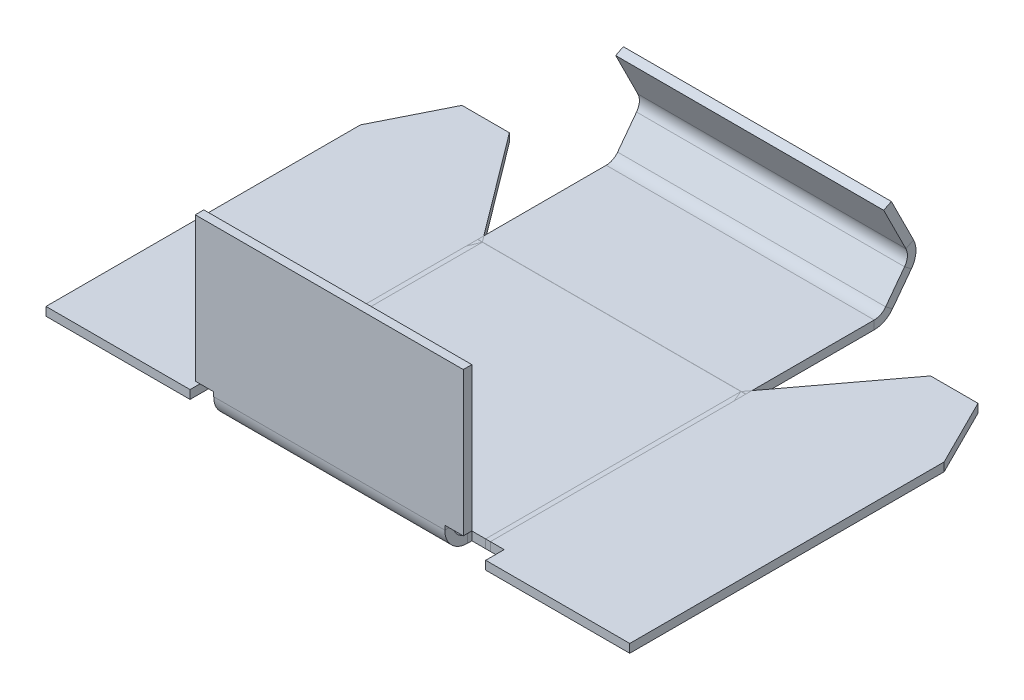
ISO-10303-21;
HEADER;
FILE_DESCRIPTION(('STEP AP214'),'2;1');
FILE_NAME('part.step','',(''),(''),'','','');
FILE_SCHEMA(('AUTOMOTIVE_DESIGN { 1 0 10303 214 1 1 1 1 }'));
ENDSEC;
DATA;
#1=APPLICATION_CONTEXT('core data for automotive mechanical design processes');
#2=APPLICATION_PROTOCOL_DEFINITION('international standard','automotive_design',2000,#1);
#3=PRODUCT_CONTEXT('',#1,'mechanical');
#4=PRODUCT('Part','Part','',(#3));
#5=PRODUCT_RELATED_PRODUCT_CATEGORY('part','',(#4));
#6=PRODUCT_DEFINITION_FORMATION('','',#4);
#7=PRODUCT_DEFINITION_CONTEXT('part definition',#1,'design');
#8=PRODUCT_DEFINITION('design','',#6,#7);
#9=PRODUCT_DEFINITION_SHAPE('','',#8);
#10=(LENGTH_UNIT() NAMED_UNIT(*) SI_UNIT(.MILLI.,.METRE.));
#11=(NAMED_UNIT(*) PLANE_ANGLE_UNIT() SI_UNIT($,.RADIAN.));
#12=(NAMED_UNIT(*) SI_UNIT($,.STERADIAN.) SOLID_ANGLE_UNIT());
#13=UNCERTAINTY_MEASURE_WITH_UNIT(LENGTH_MEASURE(1.E-05),#10,'distance_accuracy_value','');
#14=(GEOMETRIC_REPRESENTATION_CONTEXT(3) GLOBAL_UNCERTAINTY_ASSIGNED_CONTEXT((#13)) GLOBAL_UNIT_ASSIGNED_CONTEXT((#10,
#11,#12)) REPRESENTATION_CONTEXT('',''));
#15=CARTESIAN_POINT('',(0.,0.,0.));
#16=DIRECTION('',(0.,0.,1.));
#17=DIRECTION('',(1.,0.,0.));
#18=AXIS2_PLACEMENT_3D('',#15,#16,#17);
#19=CARTESIAN_POINT('',(50.,-25.4067838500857,11.7749564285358));
#20=DIRECTION('',(0.,-0.894427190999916,-0.447213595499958));
#21=DIRECTION('',(1.,0.,0.));
#22=AXIS2_PLACEMENT_3D('',#19,#20,#21);
#23=PLANE('',#22);
#24=DIRECTION('',(0.,0.447213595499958,-0.894427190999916));
#25=VECTOR('',#24,1.);
#26=CARTESIAN_POINT('',(48.49,-25.4067838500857,11.7749564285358));
#27=LINE('',#26,#25);
#28=CARTESIAN_POINT('',(48.49,17.3291796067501,-73.6969704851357));
#29=VERTEX_POINT('',#28);
#30=CARTESIAN_POINT('',(48.49,18.,-75.0386112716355));
#31=VERTEX_POINT('',#30);
#32=EDGE_CURVE('E425',#29,#31,#27,.T.);
#33=ORIENTED_EDGE('',*,*,#32,.T.);
#34=DIRECTION('',(-1.,0.,0.));
#35=VECTOR('',#34,1.);
#36=CARTESIAN_POINT('',(50.,18.,-75.0386112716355));
#37=LINE('',#36,#35);
#38=CARTESIAN_POINT('',(1.51,18.,-75.0386112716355));
#39=VERTEX_POINT('',#38);
#40=EDGE_CURVE('E409',#31,#39,#37,.T.);
#41=ORIENTED_EDGE('',*,*,#40,.T.);
#42=DIRECTION('',(0.,0.447213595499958,-0.894427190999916));
#43=VECTOR('',#42,1.);
#44=CARTESIAN_POINT('',(1.51,-25.4067838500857,11.7749564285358));
#45=LINE('',#44,#43);
#46=CARTESIAN_POINT('',(1.51,17.3291796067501,-73.6969704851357));
#47=VERTEX_POINT('',#46);
#48=EDGE_CURVE('E426',#47,#39,#45,.T.);
#49=ORIENTED_EDGE('',*,*,#48,.F.);
#50=DIRECTION('',(-1.,0.,0.));
#51=VECTOR('',#50,1.);
#52=CARTESIAN_POINT('',(50.,17.3291796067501,-73.6969704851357));
#53=LINE('',#52,#51);
#54=EDGE_CURVE('E11',#29,#47,#53,.T.);
#55=ORIENTED_EDGE('',*,*,#54,.F.);
#56=EDGE_LOOP('',(#33,#41,#49,#55));
#57=FACE_BOUND('',#56,.T.);
#58=ADVANCED_FACE('F26',(#57),#23,.F.);
#59=CARTESIAN_POINT('',(48.49,-34.5776042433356,7.18954623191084));
#60=DIRECTION('',(-1.,0.,0.));
#61=DIRECTION('',(0.,-0.894427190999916,-0.447213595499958));
#62=AXIS2_PLACEMENT_3D('',#59,#60,#61);
#63=PLANE('',#62);
#64=DIRECTION('',(0.,0.447213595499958,-0.894427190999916));
#65=VECTOR('',#64,1.);
#66=CARTESIAN_POINT('',(48.49,-33.1956382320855,7.88052923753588));
#67=LINE('',#66,#65);
#68=CARTESIAN_POINT('',(48.49,9.54032522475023,-77.5913976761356));
#69=VERTEX_POINT('',#68);
#70=CARTESIAN_POINT('',(48.49,10.2111456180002,-78.9330384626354));
#71=VERTEX_POINT('',#70);
#72=EDGE_CURVE('E401',#69,#71,#67,.T.);
#73=ORIENTED_EDGE('',*,*,#72,.T.);
#74=DIRECTION('',(0.,0.894427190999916,0.447213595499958));
#75=VECTOR('',#74,1.);
#76=CARTESIAN_POINT('',(48.49,8.00000000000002,-80.0386112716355));
#77=LINE('',#76,#75);
#78=EDGE_CURVE('E66',#71,#31,#77,.T.);
#79=ORIENTED_EDGE('',*,*,#78,.T.);
#80=ORIENTED_EDGE('',*,*,#32,.F.);
#81=DIRECTION('',(0.,0.894427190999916,0.447213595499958));
#82=VECTOR('',#81,1.);
#83=CARTESIAN_POINT('',(48.49,8.15835921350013,-78.2823806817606));
#84=LINE('',#83,#82);
#85=EDGE_CURVE('E36',#69,#29,#84,.T.);
#86=ORIENTED_EDGE('',*,*,#85,.F.);
#87=EDGE_LOOP('',(#73,#79,#80,#86));
#88=FACE_BOUND('',#87,.T.);
#89=ADVANCED_FACE('F424',(#88),#63,.F.);
#90=CARTESIAN_POINT('',(50.,18.,-75.0386112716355));
#91=DIRECTION('',(0.,-0.447213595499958,0.894427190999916));
#92=DIRECTION('',(0.,-0.894427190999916,-0.447213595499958));
#93=AXIS2_PLACEMENT_3D('',#90,#91,#92);
#94=PLANE('',#93);
#95=ORIENTED_EDGE('',*,*,#78,.F.);
#96=DIRECTION('',(-1.,0.,0.));
#97=VECTOR('',#96,1.);
#98=CARTESIAN_POINT('',(48.49,10.2111456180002,-78.9330384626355));
#99=LINE('',#98,#97);
#100=CARTESIAN_POINT('',(1.51,10.2111456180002,-78.9330384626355));
#101=VERTEX_POINT('',#100);
#102=EDGE_CURVE('E435',#71,#101,#99,.T.);
#103=ORIENTED_EDGE('',*,*,#102,.T.);
#104=DIRECTION('',(0.,0.894427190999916,0.447213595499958));
#105=VECTOR('',#104,1.);
#106=CARTESIAN_POINT('',(1.51,8.82917960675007,-79.6240214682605));
#107=LINE('',#106,#105);
#108=EDGE_CURVE('E432',#101,#39,#107,.T.);
#109=ORIENTED_EDGE('',*,*,#108,.T.);
#110=ORIENTED_EDGE('',*,*,#40,.F.);
#111=EDGE_LOOP('',(#95,#103,#109,#110));
#112=FACE_BOUND('',#111,.T.);
#113=ADVANCED_FACE('F447',(#112),#94,.F.);
#114=CARTESIAN_POINT('',(1.51,-34.5776042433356,7.18954623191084));
#115=DIRECTION('',(-1.,0.,0.));
#116=DIRECTION('',(0.,-0.894427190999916,-0.447213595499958));
#117=AXIS2_PLACEMENT_3D('',#114,#115,#116);
#118=PLANE('',#117);
#119=ORIENTED_EDGE('',*,*,#108,.F.);
#120=DIRECTION('',(0.,0.447213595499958,-0.894427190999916));
#121=VECTOR('',#120,1.);
#122=CARTESIAN_POINT('',(1.51,-33.1956382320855,7.88052923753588));
#123=LINE('',#122,#121);
#124=CARTESIAN_POINT('',(1.51000000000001,9.54032522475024,-77.5913976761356));
#125=VERTEX_POINT('',#124);
#126=EDGE_CURVE('E423',#125,#101,#123,.T.);
#127=ORIENTED_EDGE('',*,*,#126,.F.);
#128=DIRECTION('',(0.,0.894427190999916,0.447213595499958));
#129=VECTOR('',#128,1.);
#130=CARTESIAN_POINT('',(1.51,8.15835921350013,-78.2823806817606));
#131=LINE('',#130,#129);
#132=EDGE_CURVE('E421',#125,#47,#131,.T.);
#133=ORIENTED_EDGE('',*,*,#132,.T.);
#134=ORIENTED_EDGE('',*,*,#48,.T.);
#135=EDGE_LOOP('',(#119,#127,#133,#134));
#136=FACE_BOUND('',#135,.T.);
#137=ADVANCED_FACE('F449',(#136),#118,.T.);
#138=CARTESIAN_POINT('',(50.,17.3291796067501,-73.6969704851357));
#139=DIRECTION('',(0.,-0.447213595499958,0.894427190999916));
#140=DIRECTION('',(0.,-0.894427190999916,-0.447213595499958));
#141=AXIS2_PLACEMENT_3D('',#138,#139,#140);
#142=PLANE('',#141);
#143=DIRECTION('',(-1.,0.,0.));
#144=VECTOR('',#143,1.);
#145=CARTESIAN_POINT('',(48.49,9.54032522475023,-77.5913976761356));
#146=LINE('',#145,#144);
#147=EDGE_CURVE('E30',#69,#125,#146,.T.);
#148=ORIENTED_EDGE('',*,*,#147,.F.);
#149=ORIENTED_EDGE('',*,*,#85,.T.);
#150=ORIENTED_EDGE('',*,*,#54,.T.);
#151=ORIENTED_EDGE('',*,*,#132,.F.);
#152=EDGE_LOOP('',(#148,#149,#150,#151));
#153=FACE_BOUND('',#152,.T.);
#154=ADVANCED_FACE('F28',(#153),#142,.T.);
#155=CARTESIAN_POINT('',(48.49,58.2649175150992,2.39794541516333));
#156=DIRECTION('',(-1.,0.,0.));
#157=DIRECTION('',(0.,-0.8,0.600000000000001));
#158=AXIS2_PLACEMENT_3D('',#155,#156,#157);
#159=PLANE('',#158);
#160=DIRECTION('',(0.,-0.600000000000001,-0.8));
#161=VECTOR('',#160,1.);
#162=CARTESIAN_POINT('',(48.49,59.2649175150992,1.64794541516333));
#163=LINE('',#162,#161);
#164=CARTESIAN_POINT('',(48.49,2.49999999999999,-74.0386112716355));
#165=VERTEX_POINT('',#164);
#166=CARTESIAN_POINT('',(48.49,1.59999999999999,-75.2386112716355));
#167=VERTEX_POINT('',#166);
#168=EDGE_CURVE('E510',#165,#167,#163,.T.);
#169=ORIENTED_EDGE('',*,*,#168,.T.);
#170=DIRECTION('',(0.,0.8,-0.600000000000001));
#171=VECTOR('',#170,1.);
#172=CARTESIAN_POINT('',(48.49,0.,-74.0386112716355));
#173=LINE('',#172,#171);
#174=CARTESIAN_POINT('',(48.49,6.02229123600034,-78.5553296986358));
#175=VERTEX_POINT('',#174);
#176=EDGE_CURVE('E504',#167,#175,#173,.T.);
#177=ORIENTED_EDGE('',*,*,#176,.T.);
#178=DIRECTION('',(0.,-0.600000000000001,-0.8));
#179=VECTOR('',#178,1.);
#180=CARTESIAN_POINT('',(48.49,63.6872087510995,-1.66877301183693));
#181=LINE('',#180,#179);
#182=CARTESIAN_POINT('',(48.49,6.92229123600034,-77.3553296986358));
#183=VERTEX_POINT('',#182);
#184=EDGE_CURVE('E512',#183,#175,#181,.T.);
#185=ORIENTED_EDGE('',*,*,#184,.F.);
#186=DIRECTION('',(0.,0.8,-0.600000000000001));
#187=VECTOR('',#186,1.);
#188=CARTESIAN_POINT('',(48.49,1.50000000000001,-73.2886112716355));
#189=LINE('',#188,#187);
#190=EDGE_CURVE('E593',#165,#183,#189,.T.);
#191=ORIENTED_EDGE('',*,*,#190,.F.);
#192=EDGE_LOOP('',(#169,#177,#185,#191));
#193=FACE_BOUND('',#192,.T.);
#194=ADVANCED_FACE('F467',(#193),#159,.F.);
#195=CARTESIAN_POINT('',(50.,0.,-74.0386112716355));
#196=DIRECTION('',(0.,0.600000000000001,0.8));
#197=DIRECTION('',(1.,0.,0.));
#198=AXIS2_PLACEMENT_3D('',#195,#196,#197);
#199=PLANE('',#198);
#200=DIRECTION('',(-1.,0.,0.));
#201=VECTOR('',#200,1.);
#202=CARTESIAN_POINT('',(48.49,6.02229123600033,-78.5553296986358));
#203=LINE('',#202,#201);
#204=CARTESIAN_POINT('',(1.51,6.02229123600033,-78.5553296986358));
#205=VERTEX_POINT('',#204);
#206=EDGE_CURVE('E514',#175,#205,#203,.T.);
#207=ORIENTED_EDGE('',*,*,#206,.F.);
#208=ORIENTED_EDGE('',*,*,#176,.F.);
#209=DIRECTION('',(-1.,0.,0.));
#210=VECTOR('',#209,1.);
#211=CARTESIAN_POINT('',(48.49,1.6,-75.2386112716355));
#212=LINE('',#211,#210);
#213=CARTESIAN_POINT('',(1.51,1.6,-75.2386112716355));
#214=VERTEX_POINT('',#213);
#215=EDGE_CURVE('E501',#167,#214,#212,.T.);
#216=ORIENTED_EDGE('',*,*,#215,.T.);
#217=DIRECTION('',(0.,0.8,-0.600000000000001));
#218=VECTOR('',#217,1.);
#219=CARTESIAN_POINT('',(1.51,0.,-74.0386112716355));
#220=LINE('',#219,#218);
#221=EDGE_CURVE('E494',#214,#205,#220,.T.);
#222=ORIENTED_EDGE('',*,*,#221,.T.);
#223=EDGE_LOOP('',(#207,#208,#216,#222));
#224=FACE_BOUND('',#223,.T.);
#225=ADVANCED_FACE('F471',(#224),#199,.F.);
#226=CARTESIAN_POINT('',(1.51,58.2649175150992,2.39794541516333));
#227=DIRECTION('',(-1.,0.,0.));
#228=DIRECTION('',(0.,-0.8,0.600000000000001));
#229=AXIS2_PLACEMENT_3D('',#226,#227,#228);
#230=PLANE('',#229);
#231=ORIENTED_EDGE('',*,*,#221,.F.);
#232=DIRECTION('',(0.,-0.600000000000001,-0.8));
#233=VECTOR('',#232,1.);
#234=CARTESIAN_POINT('',(1.51,59.2649175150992,1.64794541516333));
#235=LINE('',#234,#233);
#236=CARTESIAN_POINT('',(1.50999999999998,2.49999999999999,-74.0386112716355));
#237=VERTEX_POINT('',#236);
#238=EDGE_CURVE('E496',#237,#214,#235,.T.);
#239=ORIENTED_EDGE('',*,*,#238,.F.);
#240=DIRECTION('',(0.,0.8,-0.600000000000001));
#241=VECTOR('',#240,1.);
#242=CARTESIAN_POINT('',(1.51,1.50000000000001,-73.2886112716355));
#243=LINE('',#242,#241);
#244=CARTESIAN_POINT('',(1.51000000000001,6.92229123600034,-77.3553296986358));
#245=VERTEX_POINT('',#244);
#246=EDGE_CURVE('E500',#237,#245,#243,.T.);
#247=ORIENTED_EDGE('',*,*,#246,.T.);
#248=DIRECTION('',(0.,-0.600000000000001,-0.8));
#249=VECTOR('',#248,1.);
#250=CARTESIAN_POINT('',(1.51,63.6872087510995,-1.66877301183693));
#251=LINE('',#250,#249);
#252=EDGE_CURVE('E497',#245,#205,#251,.T.);
#253=ORIENTED_EDGE('',*,*,#252,.T.);
#254=EDGE_LOOP('',(#231,#239,#247,#253));
#255=FACE_BOUND('',#254,.T.);
#256=ADVANCED_FACE('F477',(#255),#230,.T.);
#257=CARTESIAN_POINT('',(50.,0.900000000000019,-72.8386112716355));
#258=DIRECTION('',(0.,0.600000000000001,0.8));
#259=DIRECTION('',(1.,0.,0.));
#260=AXIS2_PLACEMENT_3D('',#257,#258,#259);
#261=PLANE('',#260);
#262=ORIENTED_EDGE('',*,*,#190,.T.);
#263=DIRECTION('',(-1.,0.,0.));
#264=VECTOR('',#263,1.);
#265=CARTESIAN_POINT('',(48.49,6.92229123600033,-77.3553296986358));
#266=LINE('',#265,#264);
#267=EDGE_CURVE('E417',#183,#245,#266,.T.);
#268=ORIENTED_EDGE('',*,*,#267,.T.);
#269=ORIENTED_EDGE('',*,*,#246,.F.);
#270=DIRECTION('',(-1.,0.,0.));
#271=VECTOR('',#270,1.);
#272=CARTESIAN_POINT('',(48.49,2.5,-74.0386112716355));
#273=LINE('',#272,#271);
#274=EDGE_CURVE('E516',#165,#237,#273,.T.);
#275=ORIENTED_EDGE('',*,*,#274,.F.);
#276=EDGE_LOOP('',(#262,#268,#269,#275));
#277=FACE_BOUND('',#276,.T.);
#278=ADVANCED_FACE('F459',(#277),#261,.T.);
#279=CARTESIAN_POINT('',(1.51,1.49999999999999,-108.889392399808));
#280=DIRECTION('',(1.,0.,0.));
#281=DIRECTION('',(0.,-1.,0.));
#282=AXIS2_PLACEMENT_3D('',#279,#280,#281);
#283=PLANE('',#282);
#284=DIRECTION('',(0.,0.,1.));
#285=VECTOR('',#284,1.);
#286=CARTESIAN_POINT('',(1.51,4.74999999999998,-108.889392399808));
#287=LINE('',#286,#285);
#288=CARTESIAN_POINT('',(1.51,4.74999999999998,-1.5));
#289=VERTEX_POINT('',#288);
#290=CARTESIAN_POINT('',(1.51,4.74999999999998,0.));
#291=VERTEX_POINT('',#290);
#292=EDGE_CURVE('E584',#289,#291,#287,.T.);
#293=ORIENTED_EDGE('',*,*,#292,.T.);
#294=DIRECTION('',(0.,1.,0.));
#295=VECTOR('',#294,1.);
#296=CARTESIAN_POINT('',(1.51,0.,0.));
#297=LINE('',#296,#295);
#298=CARTESIAN_POINT('',(1.51,30.,0.));
#299=VERTEX_POINT('',#298);
#300=EDGE_CURVE('E581',#291,#299,#297,.T.);
#301=ORIENTED_EDGE('',*,*,#300,.T.);
#302=DIRECTION('',(0.,0.,1.));
#303=VECTOR('',#302,1.);
#304=CARTESIAN_POINT('',(1.51,30.,-108.889392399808));
#305=LINE('',#304,#303);
#306=CARTESIAN_POINT('',(1.51,30.,-1.5));
#307=VERTEX_POINT('',#306);
#308=EDGE_CURVE('E576',#307,#299,#305,.T.);
#309=ORIENTED_EDGE('',*,*,#308,.F.);
#310=DIRECTION('',(0.,1.,0.));
#311=VECTOR('',#310,1.);
#312=CARTESIAN_POINT('',(1.51,1.5,-1.5));
#313=LINE('',#312,#311);
#314=EDGE_CURVE('E524',#289,#307,#313,.T.);
#315=ORIENTED_EDGE('',*,*,#314,.F.);
#316=EDGE_LOOP('',(#293,#301,#309,#315));
#317=FACE_BOUND('',#316,.T.);
#318=ADVANCED_FACE('F489',(#317),#283,.F.);
#319=CARTESIAN_POINT('',(50.,30.,-108.889392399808));
#320=DIRECTION('',(0.,1.,0.));
#321=DIRECTION('',(0.,0.,1.));
#322=AXIS2_PLACEMENT_3D('',#319,#320,#321);
#323=PLANE('',#322);
#324=DIRECTION('',(-1.,0.,0.));
#325=VECTOR('',#324,1.);
#326=CARTESIAN_POINT('',(50.,30.,0.));
#327=LINE('',#326,#325);
#328=CARTESIAN_POINT('',(48.49,30.,0.));
#329=VERTEX_POINT('',#328);
#330=EDGE_CURVE('E546',#329,#299,#327,.T.);
#331=ORIENTED_EDGE('',*,*,#330,.F.);
#332=DIRECTION('',(0.,0.,1.));
#333=VECTOR('',#332,1.);
#334=CARTESIAN_POINT('',(48.49,30.,-108.889392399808));
#335=LINE('',#334,#333);
#336=CARTESIAN_POINT('',(48.49,30.,-1.5));
#337=VERTEX_POINT('',#336);
#338=EDGE_CURVE('E571',#337,#329,#335,.T.);
#339=ORIENTED_EDGE('',*,*,#338,.F.);
#340=DIRECTION('',(-1.,0.,0.));
#341=VECTOR('',#340,1.);
#342=CARTESIAN_POINT('',(50.,30.,-1.5));
#343=LINE('',#342,#341);
#344=EDGE_CURVE('E579',#337,#307,#343,.T.);
#345=ORIENTED_EDGE('',*,*,#344,.T.);
#346=ORIENTED_EDGE('',*,*,#308,.T.);
#347=EDGE_LOOP('',(#331,#339,#345,#346));
#348=FACE_BOUND('',#347,.T.);
#349=ADVANCED_FACE('F1180',(#348),#323,.T.);
#350=CARTESIAN_POINT('',(48.49,1.49999999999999,-108.889392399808));
#351=DIRECTION('',(1.,0.,0.));
#352=DIRECTION('',(0.,-1.,0.));
#353=AXIS2_PLACEMENT_3D('',#350,#351,#352);
#354=PLANE('',#353);
#355=DIRECTION('',(0.,1.,0.));
#356=VECTOR('',#355,1.);
#357=CARTESIAN_POINT('',(48.49,0.,0.));
#358=LINE('',#357,#356);
#359=CARTESIAN_POINT('',(48.49,4.74999999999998,0.));
#360=VERTEX_POINT('',#359);
#361=EDGE_CURVE('E548',#360,#329,#358,.T.);
#362=ORIENTED_EDGE('',*,*,#361,.F.);
#363=DIRECTION('',(0.,0.,1.));
#364=VECTOR('',#363,1.);
#365=CARTESIAN_POINT('',(48.49,4.74999999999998,-108.889392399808));
#366=LINE('',#365,#364);
#367=CARTESIAN_POINT('',(48.49,4.74999999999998,-1.5));
#368=VERTEX_POINT('',#367);
#369=EDGE_CURVE('E566',#368,#360,#366,.T.);
#370=ORIENTED_EDGE('',*,*,#369,.F.);
#371=DIRECTION('',(0.,1.,0.));
#372=VECTOR('',#371,1.);
#373=CARTESIAN_POINT('',(48.49,1.5,-1.5));
#374=LINE('',#373,#372);
#375=EDGE_CURVE('E574',#368,#337,#374,.T.);
#376=ORIENTED_EDGE('',*,*,#375,.T.);
#377=ORIENTED_EDGE('',*,*,#338,.T.);
#378=EDGE_LOOP('',(#362,#370,#376,#377));
#379=FACE_BOUND('',#378,.T.);
#380=ADVANCED_FACE('F1176',(#379),#354,.T.);
#381=CARTESIAN_POINT('',(50.,4.74999999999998,-108.889392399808));
#382=DIRECTION('',(0.,-1.,0.));
#383=DIRECTION('',(0.,0.,-1.));
#384=AXIS2_PLACEMENT_3D('',#381,#382,#383);
#385=PLANE('',#384);
#386=DIRECTION('',(1.,0.,0.));
#387=VECTOR('',#386,1.);
#388=CARTESIAN_POINT('',(50.,4.74999999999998,0.));
#389=LINE('',#388,#387);
#390=CARTESIAN_POINT('',(45.25,4.74999999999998,0.));
#391=VERTEX_POINT('',#390);
#392=EDGE_CURVE('E550',#391,#360,#389,.T.);
#393=ORIENTED_EDGE('',*,*,#392,.F.);
#394=DIRECTION('',(0.,0.,1.));
#395=VECTOR('',#394,1.);
#396=CARTESIAN_POINT('',(45.25,4.74999999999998,-108.889392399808));
#397=LINE('',#396,#395);
#398=CARTESIAN_POINT('',(45.25,4.74999999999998,-1.5));
#399=VERTEX_POINT('',#398);
#400=EDGE_CURVE('E541',#399,#391,#397,.T.);
#401=ORIENTED_EDGE('',*,*,#400,.F.);
#402=DIRECTION('',(1.,0.,0.));
#403=VECTOR('',#402,1.);
#404=CARTESIAN_POINT('',(50.,4.74999999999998,-1.5));
#405=LINE('',#404,#403);
#406=EDGE_CURVE('E569',#399,#368,#405,.T.);
#407=ORIENTED_EDGE('',*,*,#406,.T.);
#408=ORIENTED_EDGE('',*,*,#369,.T.);
#409=EDGE_LOOP('',(#393,#401,#407,#408));
#410=FACE_BOUND('',#409,.T.);
#411=ADVANCED_FACE('F1172',(#410),#385,.T.);
#412=CARTESIAN_POINT('',(50.,4.74999999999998,-108.889392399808));
#413=DIRECTION('',(0.,-1.,0.));
#414=DIRECTION('',(0.,0.,-1.));
#415=AXIS2_PLACEMENT_3D('',#412,#413,#414);
#416=PLANE('',#415);
#417=DIRECTION('',(1.,0.,0.));
#418=VECTOR('',#417,1.);
#419=CARTESIAN_POINT('',(50.,4.74999999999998,0.));
#420=LINE('',#419,#418);
#421=CARTESIAN_POINT('',(4.74999999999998,4.74999999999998,0.));
#422=VERTEX_POINT('',#421);
#423=EDGE_CURVE('E544',#291,#422,#420,.T.);
#424=ORIENTED_EDGE('',*,*,#423,.F.);
#425=ORIENTED_EDGE('',*,*,#292,.F.);
#426=DIRECTION('',(1.,0.,0.));
#427=VECTOR('',#426,1.);
#428=CARTESIAN_POINT('',(50.,4.74999999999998,-1.5));
#429=LINE('',#428,#427);
#430=CARTESIAN_POINT('',(4.74999999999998,4.74999999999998,-1.5));
#431=VERTEX_POINT('',#430);
#432=EDGE_CURVE('E564',#289,#431,#429,.T.);
#433=ORIENTED_EDGE('',*,*,#432,.T.);
#434=DIRECTION('',(0.,0.,1.));
#435=VECTOR('',#434,1.);
#436=CARTESIAN_POINT('',(4.74999999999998,4.74999999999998,-108.889392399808));
#437=LINE('',#436,#435);
#438=EDGE_CURVE('E561',#431,#422,#437,.T.);
#439=ORIENTED_EDGE('',*,*,#438,.T.);
#440=EDGE_LOOP('',(#424,#425,#433,#439));
#441=FACE_BOUND('',#440,.T.);
#442=ADVANCED_FACE('F1169',(#441),#416,.T.);
#443=CARTESIAN_POINT('',(4.74999999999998,30.,-108.889392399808));
#444=DIRECTION('',(1.,0.,0.));
#445=DIRECTION('',(0.,-1.,0.));
#446=AXIS2_PLACEMENT_3D('',#443,#444,#445);
#447=PLANE('',#446);
#448=DIRECTION('',(0.,0.,1.));
#449=VECTOR('',#448,1.);
#450=CARTESIAN_POINT('',(4.74999999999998,3.99999999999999,-108.889392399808));
#451=LINE('',#450,#449);
#452=CARTESIAN_POINT('',(4.74999999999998,4.,-1.5));
#453=VERTEX_POINT('',#452);
#454=CARTESIAN_POINT('',(4.74999999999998,4.,0.));
#455=VERTEX_POINT('',#454);
#456=EDGE_CURVE('E558',#453,#455,#451,.T.);
#457=ORIENTED_EDGE('',*,*,#456,.T.);
#458=DIRECTION('',(0.,1.,0.));
#459=VECTOR('',#458,1.);
#460=CARTESIAN_POINT('',(4.74999999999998,30.,0.));
#461=LINE('',#460,#459);
#462=EDGE_CURVE('E555',#455,#422,#461,.T.);
#463=ORIENTED_EDGE('',*,*,#462,.T.);
#464=ORIENTED_EDGE('',*,*,#438,.F.);
#465=DIRECTION('',(0.,1.,0.));
#466=VECTOR('',#465,1.);
#467=CARTESIAN_POINT('',(4.74999999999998,30.,-1.5));
#468=LINE('',#467,#466);
#469=EDGE_CURVE('E530',#453,#431,#468,.T.);
#470=ORIENTED_EDGE('',*,*,#469,.F.);
#471=EDGE_LOOP('',(#457,#463,#464,#470));
#472=FACE_BOUND('',#471,.T.);
#473=ADVANCED_FACE('F1152',(#472),#447,.F.);
#474=CARTESIAN_POINT('',(50.,30.,0.));
#475=DIRECTION('',(0.,0.,-1.));
#476=DIRECTION('',(0.,1.,0.));
#477=AXIS2_PLACEMENT_3D('',#474,#475,#476);
#478=PLANE('',#477);
#479=ORIENTED_EDGE('',*,*,#462,.F.);
#480=DIRECTION('',(1.,0.,0.));
#481=VECTOR('',#480,1.);
#482=CARTESIAN_POINT('',(4.74999999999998,4.,0.));
#483=LINE('',#482,#481);
#484=CARTESIAN_POINT('',(45.25,4.,0.));
#485=VERTEX_POINT('',#484);
#486=EDGE_CURVE('E552',#455,#485,#483,.T.);
#487=ORIENTED_EDGE('',*,*,#486,.T.);
#488=DIRECTION('',(0.,-1.,0.));
#489=VECTOR('',#488,1.);
#490=CARTESIAN_POINT('',(45.25,30.,0.));
#491=LINE('',#490,#489);
#492=EDGE_CURVE('E538',#391,#485,#491,.T.);
#493=ORIENTED_EDGE('',*,*,#492,.F.);
#494=ORIENTED_EDGE('',*,*,#392,.T.);
#495=ORIENTED_EDGE('',*,*,#361,.T.);
#496=ORIENTED_EDGE('',*,*,#330,.T.);
#497=ORIENTED_EDGE('',*,*,#300,.F.);
#498=ORIENTED_EDGE('',*,*,#423,.T.);
#499=EDGE_LOOP('',(#479,#487,#493,#494,#495,#496,#497,#498));
#500=FACE_BOUND('',#499,.T.);
#501=ADVANCED_FACE('F1148',(#500),#478,.F.);
#502=CARTESIAN_POINT('',(45.25,30.,-108.889392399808));
#503=DIRECTION('',(-1.,0.,0.));
#504=DIRECTION('',(0.,1.,0.));
#505=AXIS2_PLACEMENT_3D('',#502,#503,#504);
#506=PLANE('',#505);
#507=ORIENTED_EDGE('',*,*,#400,.T.);
#508=ORIENTED_EDGE('',*,*,#492,.T.);
#509=DIRECTION('',(0.,0.,1.));
#510=VECTOR('',#509,1.);
#511=CARTESIAN_POINT('',(45.25,3.99999999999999,-108.889392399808));
#512=LINE('',#511,#510);
#513=CARTESIAN_POINT('',(45.25,3.99999999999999,-1.5));
#514=VERTEX_POINT('',#513);
#515=EDGE_CURVE('E587',#514,#485,#512,.T.);
#516=ORIENTED_EDGE('',*,*,#515,.F.);
#517=DIRECTION('',(0.,-1.,0.));
#518=VECTOR('',#517,1.);
#519=CARTESIAN_POINT('',(45.25,30.,-1.5));
#520=LINE('',#519,#518);
#521=EDGE_CURVE('E517',#399,#514,#520,.T.);
#522=ORIENTED_EDGE('',*,*,#521,.F.);
#523=EDGE_LOOP('',(#507,#508,#516,#522));
#524=FACE_BOUND('',#523,.T.);
#525=ADVANCED_FACE('F1143',(#524),#506,.F.);
#526=CARTESIAN_POINT('',(50.,30.,-1.5));
#527=DIRECTION('',(0.,0.,-1.));
#528=DIRECTION('',(0.,1.,0.));
#529=AXIS2_PLACEMENT_3D('',#526,#527,#528);
#530=PLANE('',#529);
#531=DIRECTION('',(1.,0.,0.));
#532=VECTOR('',#531,1.);
#533=CARTESIAN_POINT('',(4.74999999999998,4.,-1.5));
#534=LINE('',#533,#532);
#535=EDGE_CURVE('E590',#453,#514,#534,.T.);
#536=ORIENTED_EDGE('',*,*,#535,.F.);
#537=ORIENTED_EDGE('',*,*,#469,.T.);
#538=ORIENTED_EDGE('',*,*,#432,.F.);
#539=ORIENTED_EDGE('',*,*,#314,.T.);
#540=ORIENTED_EDGE('',*,*,#344,.F.);
#541=ORIENTED_EDGE('',*,*,#375,.F.);
#542=ORIENTED_EDGE('',*,*,#406,.F.);
#543=ORIENTED_EDGE('',*,*,#521,.T.);
#544=EDGE_LOOP('',(#536,#537,#538,#539,#540,#541,#542,#543));
#545=FACE_BOUND('',#544,.T.);
#546=ADVANCED_FACE('F482',(#545),#530,.T.);
#547=CARTESIAN_POINT('',(50.,0.,0.));
#548=DIRECTION('',(0.,1.,0.));
#549=DIRECTION('',(0.,0.,1.));
#550=AXIS2_PLACEMENT_3D('',#547,#548,#549);
#551=PLANE('',#550);
#552=DIRECTION('',(0.386208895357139,0.,0.922411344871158));
#553=VECTOR('',#552,1.);
#554=CARTESIAN_POINT('',(65.0669885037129,0.,-7.91516613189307));
#555=LINE('',#554,#553);
#556=CARTESIAN_POINT('',(47.6626102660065,0.,-49.4833333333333));
#557=VERTEX_POINT('',#556);
#558=CARTESIAN_POINT('',(48.49,0.,-47.5072170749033));
#559=VERTEX_POINT('',#558);
#560=EDGE_CURVE('E533',#557,#559,#555,.T.);
#561=ORIENTED_EDGE('',*,*,#560,.F.);
#562=DIRECTION('',(-0.600000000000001,0.,0.8));
#563=VECTOR('',#562,1.);
#564=CARTESIAN_POINT('',(24.7520705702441,0.,-18.9359470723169));
#565=LINE('',#564,#563);
#566=CARTESIAN_POINT('',(47.6751102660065,0.,-49.5));
#567=VERTEX_POINT('',#566);
#568=EDGE_CURVE('E929',#567,#557,#565,.T.);
#569=ORIENTED_EDGE('',*,*,#568,.F.);
#570=DIRECTION('',(-1.,0.,0.));
#571=VECTOR('',#570,1.);
#572=CARTESIAN_POINT('',(50.,0.,-49.5));
#573=LINE('',#572,#571);
#574=CARTESIAN_POINT('',(48.49,0.,-49.5));
#575=VERTEX_POINT('',#574);
#576=EDGE_CURVE('E848',#575,#567,#573,.T.);
#577=ORIENTED_EDGE('',*,*,#576,.F.);
#578=DIRECTION('',(0.,0.,1.));
#579=VECTOR('',#578,1.);
#580=CARTESIAN_POINT('',(48.49,0.,-50.));
#581=LINE('',#580,#579);
#582=CARTESIAN_POINT('',(48.49,0.,-49.4833333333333));
#583=VERTEX_POINT('',#582);
#584=EDGE_CURVE('E837',#575,#583,#581,.T.);
#585=ORIENTED_EDGE('',*,*,#584,.T.);
#586=EDGE_CURVE('E834',#583,#559,#581,.T.);
#587=ORIENTED_EDGE('',*,*,#586,.T.);
#588=EDGE_LOOP('',(#561,#569,#577,#585,#587));
#589=FACE_BOUND('',#588,.T.);
#590=ADVANCED_FACE('F961',(#589),#551,.F.);
#591=CARTESIAN_POINT('',(50.,1.5,0.));
#592=DIRECTION('',(0.,1.,0.));
#593=DIRECTION('',(0.,0.,1.));
#594=AXIS2_PLACEMENT_3D('',#591,#592,#593);
#595=PLANE('',#594);
#596=DIRECTION('',(0.386208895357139,0.,0.922411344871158));
#597=VECTOR('',#596,1.);
#598=CARTESIAN_POINT('',(65.0669885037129,1.5,-7.91516613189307));
#599=LINE('',#598,#597);
#600=CARTESIAN_POINT('',(47.6626102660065,1.5,-49.4833333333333));
#601=VERTEX_POINT('',#600);
#602=CARTESIAN_POINT('',(48.49,1.5,-47.5072170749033));
#603=VERTEX_POINT('',#602);
#604=EDGE_CURVE('E951',#601,#603,#599,.T.);
#605=ORIENTED_EDGE('',*,*,#604,.F.);
#606=DIRECTION('',(0.,0.,1.));
#607=VECTOR('',#606,1.);
#608=CARTESIAN_POINT('',(47.6626102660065,1.5,0.));
#609=LINE('',#608,#607);
#610=CARTESIAN_POINT('',(47.6626102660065,1.5,-4.74999999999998));
#611=VERTEX_POINT('',#610);
#612=EDGE_CURVE('E938',#601,#611,#609,.T.);
#613=ORIENTED_EDGE('',*,*,#612,.T.);
#614=DIRECTION('',(1.,0.,0.));
#615=VECTOR('',#614,1.);
#616=CARTESIAN_POINT('',(50.,1.5,-4.74999999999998));
#617=LINE('',#616,#615);
#618=CARTESIAN_POINT('',(48.5,1.5,-4.74999999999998));
#619=VERTEX_POINT('',#618);
#620=EDGE_CURVE('E859',#611,#619,#617,.T.);
#621=ORIENTED_EDGE('',*,*,#620,.T.);
#622=DIRECTION('',(0.,0.,-1.));
#623=VECTOR('',#622,1.);
#624=CARTESIAN_POINT('',(48.5,1.5,0.));
#625=LINE('',#624,#623);
#626=CARTESIAN_POINT('',(48.5,1.5,-47.4833333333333));
#627=VERTEX_POINT('',#626);
#628=EDGE_CURVE('E863',#619,#627,#625,.T.);
#629=ORIENTED_EDGE('',*,*,#628,.T.);
#630=DIRECTION('',(-1.,0.,0.));
#631=VECTOR('',#630,1.);
#632=CARTESIAN_POINT('',(50.,1.5,-47.4833333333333));
#633=LINE('',#632,#631);
#634=CARTESIAN_POINT('',(48.49,1.5,-47.4833333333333));
#635=VERTEX_POINT('',#634);
#636=EDGE_CURVE('E894',#627,#635,#633,.T.);
#637=ORIENTED_EDGE('',*,*,#636,.T.);
#638=DIRECTION('',(0.,0.,1.));
#639=VECTOR('',#638,1.);
#640=CARTESIAN_POINT('',(48.49,1.5,-50.));
#641=LINE('',#640,#639);
#642=EDGE_CURVE('E890',#603,#635,#641,.T.);
#643=ORIENTED_EDGE('',*,*,#642,.F.);
#644=EDGE_LOOP('',(#605,#613,#621,#629,#637,#643));
#645=FACE_BOUND('',#644,.T.);
#646=ADVANCED_FACE('F984',(#645),#595,.T.);
#647=DIRECTION('',(-0.38620889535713,0.,0.922411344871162));
#648=VECTOR('',#647,1.);
#649=CARTESIAN_POINT('',(-15.0669885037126,1.5,-7.91516613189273));
#650=LINE('',#649,#648);
#651=CARTESIAN_POINT('',(2.33738973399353,1.5,-49.4833333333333));
#652=VERTEX_POINT('',#651);
#653=CARTESIAN_POINT('',(1.51,1.5,-47.5072170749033));
#654=VERTEX_POINT('',#653);
#655=EDGE_CURVE('E950',#652,#654,#650,.T.);
#656=ORIENTED_EDGE('',*,*,#655,.F.);
#657=DIRECTION('',(0.600000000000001,0.,0.799999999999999));
#658=VECTOR('',#657,1.);
#659=CARTESIAN_POINT('',(43.2479294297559,1.5,5.06405292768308));
#660=LINE('',#659,#658);
#661=CARTESIAN_POINT('',(2.32488973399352,1.5,-49.5));
#662=VERTEX_POINT('',#661);
#663=EDGE_CURVE('E935',#662,#652,#660,.T.);
#664=ORIENTED_EDGE('',*,*,#663,.F.);
#665=DIRECTION('',(-1.,0.,0.));
#666=VECTOR('',#665,1.);
#667=CARTESIAN_POINT('',(3.83738973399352,1.5,-49.5));
#668=LINE('',#667,#666);
#669=CARTESIAN_POINT('',(1.51,1.5,-49.5));
#670=VERTEX_POINT('',#669);
#671=EDGE_CURVE('E699',#662,#670,#668,.T.);
#672=ORIENTED_EDGE('',*,*,#671,.T.);
#673=DIRECTION('',(0.,0.,1.));
#674=VECTOR('',#673,1.);
#675=CARTESIAN_POINT('',(1.51,1.5,-49.5));
#676=LINE('',#675,#674);
#677=CARTESIAN_POINT('',(1.51,1.5,-49.4833333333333));
#678=VERTEX_POINT('',#677);
#679=EDGE_CURVE('E871',#670,#678,#676,.T.);
#680=ORIENTED_EDGE('',*,*,#679,.T.);
#681=DIRECTION('',(0.,0.,1.));
#682=VECTOR('',#681,1.);
#683=CARTESIAN_POINT('',(1.51,1.5,-50.));
#684=LINE('',#683,#682);
#685=EDGE_CURVE('E887',#678,#654,#684,.T.);
#686=ORIENTED_EDGE('',*,*,#685,.T.);
#687=EDGE_LOOP('',(#656,#664,#672,#680,#686));
#688=FACE_BOUND('',#687,.T.);
#689=ADVANCED_FACE('F1019',(#688),#595,.T.);
#690=DIRECTION('',(-0.38620889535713,0.,0.922411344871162));
#691=VECTOR('',#690,1.);
#692=CARTESIAN_POINT('',(-15.0669885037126,0.,-7.91516613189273));
#693=LINE('',#692,#691);
#694=CARTESIAN_POINT('',(2.33738973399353,0.,-49.4833333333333));
#695=VERTEX_POINT('',#694);
#696=CARTESIAN_POINT('',(1.51,0.,-47.5072170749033));
#697=VERTEX_POINT('',#696);
#698=EDGE_CURVE('E948',#695,#697,#693,.T.);
#699=ORIENTED_EDGE('',*,*,#698,.F.);
#700=DIRECTION('',(0.,0.,1.));
#701=VECTOR('',#700,1.);
#702=CARTESIAN_POINT('',(2.33738973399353,0.,0.));
#703=LINE('',#702,#701);
#704=CARTESIAN_POINT('',(2.33738973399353,0.,-4.74999999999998));
#705=VERTEX_POINT('',#704);
#706=EDGE_CURVE('E920',#695,#705,#703,.T.);
#707=ORIENTED_EDGE('',*,*,#706,.T.);
#708=DIRECTION('',(1.,0.,0.));
#709=VECTOR('',#708,1.);
#710=CARTESIAN_POINT('',(50.,0.,-4.74999999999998));
#711=LINE('',#710,#709);
#712=CARTESIAN_POINT('',(1.5,0.,-4.74999999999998));
#713=VERTEX_POINT('',#712);
#714=EDGE_CURVE('E917',#713,#705,#711,.T.);
#715=ORIENTED_EDGE('',*,*,#714,.F.);
#716=DIRECTION('',(0.,0.,-1.));
#717=VECTOR('',#716,1.);
#718=CARTESIAN_POINT('',(1.5,0.,0.));
#719=LINE('',#718,#717);
#720=CARTESIAN_POINT('',(1.5,0.,-47.4833333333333));
#721=VERTEX_POINT('',#720);
#722=EDGE_CURVE('E846',#713,#721,#719,.T.);
#723=ORIENTED_EDGE('',*,*,#722,.T.);
#724=DIRECTION('',(1.,0.,0.));
#725=VECTOR('',#724,1.);
#726=CARTESIAN_POINT('',(0.,0.,-47.4833333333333));
#727=LINE('',#726,#725);
#728=CARTESIAN_POINT('',(1.51,0.,-47.4833333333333));
#729=VERTEX_POINT('',#728);
#730=EDGE_CURVE('E827',#721,#729,#727,.T.);
#731=ORIENTED_EDGE('',*,*,#730,.T.);
#732=DIRECTION('',(0.,0.,1.));
#733=VECTOR('',#732,1.);
#734=CARTESIAN_POINT('',(1.51,0.,-50.));
#735=LINE('',#734,#733);
#736=EDGE_CURVE('E829',#697,#729,#735,.T.);
#737=ORIENTED_EDGE('',*,*,#736,.F.);
#738=EDGE_LOOP('',(#699,#707,#715,#723,#731,#737));
#739=FACE_BOUND('',#738,.T.);
#740=ADVANCED_FACE('F1132',(#739),#551,.F.);
#741=CARTESIAN_POINT('',(50.,132.331953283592,-4.74999999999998));
#742=DIRECTION('',(0.,0.,-1.));
#743=DIRECTION('',(-1.,0.,0.));
#744=AXIS2_PLACEMENT_3D('',#741,#742,#743);
#745=PLANE('',#744);
#746=DIRECTION('',(0.,1.,0.));
#747=VECTOR('',#746,1.);
#748=CARTESIAN_POINT('',(47.6626102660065,132.331953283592,-4.74999999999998));
#749=LINE('',#748,#747);
#750=CARTESIAN_POINT('',(47.6626102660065,0.,-4.74999999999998));
#751=VERTEX_POINT('',#750);
#752=EDGE_CURVE('E946',#751,#611,#749,.T.);
#753=ORIENTED_EDGE('',*,*,#752,.F.);
#754=DIRECTION('',(1.,0.,0.));
#755=VECTOR('',#754,1.);
#756=CARTESIAN_POINT('',(50.,0.,-4.74999999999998));
#757=LINE('',#756,#755);
#758=CARTESIAN_POINT('',(48.5,0.,-4.74999999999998));
#759=VERTEX_POINT('',#758);
#760=EDGE_CURVE('E842',#751,#759,#757,.T.);
#761=ORIENTED_EDGE('',*,*,#760,.T.);
#762=DIRECTION('',(0.,-1.,0.));
#763=VECTOR('',#762,1.);
#764=CARTESIAN_POINT('',(48.5,132.331953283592,-4.74999999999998));
#765=LINE('',#764,#763);
#766=EDGE_CURVE('E905',#619,#759,#765,.T.);
#767=ORIENTED_EDGE('',*,*,#766,.F.);
#768=ORIENTED_EDGE('',*,*,#620,.F.);
#769=EDGE_LOOP('',(#753,#761,#767,#768));
#770=FACE_BOUND('',#769,.T.);
#771=ADVANCED_FACE('F978',(#770),#745,.F.);
#772=CARTESIAN_POINT('',(50.,132.331953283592,-4.74999999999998));
#773=DIRECTION('',(0.,0.,-1.));
#774=DIRECTION('',(-1.,0.,0.));
#775=AXIS2_PLACEMENT_3D('',#772,#773,#774);
#776=PLANE('',#775);
#777=DIRECTION('',(0.,1.,0.));
#778=VECTOR('',#777,1.);
#779=CARTESIAN_POINT('',(2.33738973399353,132.331953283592,-4.74999999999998));
#780=LINE('',#779,#778);
#781=CARTESIAN_POINT('',(2.33738973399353,1.5,-4.74999999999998));
#782=VERTEX_POINT('',#781);
#783=EDGE_CURVE('E944',#705,#782,#780,.T.);
#784=ORIENTED_EDGE('',*,*,#783,.F.);
#785=CARTESIAN_POINT('',(4.74999999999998,0.,-4.74999999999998));
#786=VERTEX_POINT('',#785);
#787=EDGE_CURVE('E916',#705,#786,#711,.T.);
#788=ORIENTED_EDGE('',*,*,#787,.T.);
#789=DIRECTION('',(0.,-1.,0.));
#790=VECTOR('',#789,1.);
#791=CARTESIAN_POINT('',(4.74999999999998,132.331953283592,-4.74999999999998));
#792=LINE('',#791,#790);
#793=CARTESIAN_POINT('',(4.74999999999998,1.5,-4.74999999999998));
#794=VERTEX_POINT('',#793);
#795=EDGE_CURVE('E899',#794,#786,#792,.T.);
#796=ORIENTED_EDGE('',*,*,#795,.F.);
#797=DIRECTION('',(1.,0.,0.));
#798=VECTOR('',#797,1.);
#799=CARTESIAN_POINT('',(50.,1.5,-4.74999999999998));
#800=LINE('',#799,#798);
#801=EDGE_CURVE('E876',#782,#794,#800,.T.);
#802=ORIENTED_EDGE('',*,*,#801,.F.);
#803=EDGE_LOOP('',(#784,#788,#796,#802));
#804=FACE_BOUND('',#803,.T.);
#805=ADVANCED_FACE('F1036',(#804),#776,.F.);
#806=DIRECTION('',(-1.,0.,0.));
#807=VECTOR('',#806,1.);
#808=CARTESIAN_POINT('',(50.,1.5,-49.5));
#809=LINE('',#808,#807);
#810=CARTESIAN_POINT('',(48.49,1.5,-49.5));
#811=VERTEX_POINT('',#810);
#812=CARTESIAN_POINT('',(47.6751102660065,1.5,-49.5));
#813=VERTEX_POINT('',#812);
#814=EDGE_CURVE('E868',#811,#813,#809,.T.);
#815=ORIENTED_EDGE('',*,*,#814,.T.);
#816=DIRECTION('',(-0.600000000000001,0.,0.8));
#817=VECTOR('',#816,1.);
#818=CARTESIAN_POINT('',(24.7520705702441,1.5,-18.9359470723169));
#819=LINE('',#818,#817);
#820=EDGE_CURVE('E941',#813,#601,#819,.T.);
#821=ORIENTED_EDGE('',*,*,#820,.T.);
#822=ORIENTED_EDGE('',*,*,#604,.T.);
#823=CARTESIAN_POINT('',(48.49,1.5,-49.4833333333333));
#824=VERTEX_POINT('',#823);
#825=EDGE_CURVE('E891',#824,#603,#641,.T.);
#826=ORIENTED_EDGE('',*,*,#825,.F.);
#827=DIRECTION('',(0.,0.,1.));
#828=VECTOR('',#827,1.);
#829=CARTESIAN_POINT('',(48.49,1.5,-49.5));
#830=LINE('',#829,#828);
#831=EDGE_CURVE('E865',#811,#824,#830,.T.);
#832=ORIENTED_EDGE('',*,*,#831,.F.);
#833=EDGE_LOOP('',(#815,#821,#822,#826,#832));
#834=FACE_BOUND('',#833,.T.);
#835=ADVANCED_FACE('F989',(#834),#595,.T.);
#836=ORIENTED_EDGE('',*,*,#820,.F.);
#837=DIRECTION('',(-1.,0.,0.));
#838=VECTOR('',#837,1.);
#839=CARTESIAN_POINT('',(48.49,1.5,-49.5));
#840=LINE('',#839,#838);
#841=EDGE_CURVE('E621',#813,#662,#840,.T.);
#842=ORIENTED_EDGE('',*,*,#841,.T.);
#843=ORIENTED_EDGE('',*,*,#663,.T.);
#844=DIRECTION('',(0.,0.,1.));
#845=VECTOR('',#844,1.);
#846=CARTESIAN_POINT('',(2.33738973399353,1.5,0.));
#847=LINE('',#846,#845);
#848=EDGE_CURVE('E932',#652,#782,#847,.T.);
#849=ORIENTED_EDGE('',*,*,#848,.T.);
#850=ORIENTED_EDGE('',*,*,#801,.T.);
#851=DIRECTION('',(0.,0.,1.));
#852=VECTOR('',#851,1.);
#853=CARTESIAN_POINT('',(4.74999999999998,1.5,0.));
#854=LINE('',#853,#852);
#855=CARTESIAN_POINT('',(4.74999999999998,1.5,-4.));
#856=VERTEX_POINT('',#855);
#857=EDGE_CURVE('E880',#794,#856,#854,.T.);
#858=ORIENTED_EDGE('',*,*,#857,.T.);
#859=DIRECTION('',(1.,0.,0.));
#860=VECTOR('',#859,1.);
#861=CARTESIAN_POINT('',(4.74999999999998,1.5,-4.));
#862=LINE('',#861,#860);
#863=CARTESIAN_POINT('',(45.25,1.5,-4.));
#864=VERTEX_POINT('',#863);
#865=EDGE_CURVE('E896',#856,#864,#862,.T.);
#866=ORIENTED_EDGE('',*,*,#865,.T.);
#867=DIRECTION('',(0.,0.,-1.));
#868=VECTOR('',#867,1.);
#869=CARTESIAN_POINT('',(45.25,1.5,0.));
#870=LINE('',#869,#868);
#871=CARTESIAN_POINT('',(45.25,1.5,-4.74999999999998));
#872=VERTEX_POINT('',#871);
#873=EDGE_CURVE('E856',#864,#872,#870,.T.);
#874=ORIENTED_EDGE('',*,*,#873,.T.);
#875=EDGE_CURVE('E860',#872,#611,#617,.T.);
#876=ORIENTED_EDGE('',*,*,#875,.T.);
#877=ORIENTED_EDGE('',*,*,#612,.F.);
#878=EDGE_LOOP('',(#836,#842,#843,#849,#850,#858,#866,#874,#876,#877));
#879=FACE_BOUND('',#878,.T.);
#880=ADVANCED_FACE('F1033',(#879),#595,.T.);
#881=DIRECTION('',(0.,0.,1.));
#882=VECTOR('',#881,1.);
#883=CARTESIAN_POINT('',(47.6626102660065,0.,0.));
#884=LINE('',#883,#882);
#885=EDGE_CURVE('E926',#557,#751,#884,.T.);
#886=ORIENTED_EDGE('',*,*,#885,.F.);
#887=ORIENTED_EDGE('',*,*,#560,.T.);
#888=CARTESIAN_POINT('',(48.49,0.,-47.4833333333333));
#889=VERTEX_POINT('',#888);
#890=EDGE_CURVE('E838',#559,#889,#581,.T.);
#891=ORIENTED_EDGE('',*,*,#890,.T.);
#892=DIRECTION('',(-1.,0.,0.));
#893=VECTOR('',#892,1.);
#894=CARTESIAN_POINT('',(50.,0.,-47.4833333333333));
#895=LINE('',#894,#893);
#896=CARTESIAN_POINT('',(48.5,0.,-47.4833333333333));
#897=VERTEX_POINT('',#896);
#898=EDGE_CURVE('E839',#897,#889,#895,.T.);
#899=ORIENTED_EDGE('',*,*,#898,.F.);
#900=DIRECTION('',(0.,0.,-1.));
#901=VECTOR('',#900,1.);
#902=CARTESIAN_POINT('',(48.5,0.,0.));
#903=LINE('',#902,#901);
#904=EDGE_CURVE('E851',#759,#897,#903,.T.);
#905=ORIENTED_EDGE('',*,*,#904,.F.);
#906=ORIENTED_EDGE('',*,*,#760,.F.);
#907=EDGE_LOOP('',(#886,#887,#891,#899,#905,#906));
#908=FACE_BOUND('',#907,.T.);
#909=ADVANCED_FACE('F956',(#908),#551,.F.);
#910=DIRECTION('',(-1.,0.,0.));
#911=VECTOR('',#910,1.);
#912=CARTESIAN_POINT('',(48.49,0.,-49.5));
#913=LINE('',#912,#911);
#914=CARTESIAN_POINT('',(2.32488973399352,0.,-49.5));
#915=VERTEX_POINT('',#914);
#916=EDGE_CURVE('E627',#567,#915,#913,.T.);
#917=ORIENTED_EDGE('',*,*,#916,.F.);
#918=ORIENTED_EDGE('',*,*,#568,.T.);
#919=ORIENTED_EDGE('',*,*,#885,.T.);
#920=CARTESIAN_POINT('',(45.25,0.,-4.74999999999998));
#921=VERTEX_POINT('',#920);
#922=EDGE_CURVE('E843',#921,#751,#757,.T.);
#923=ORIENTED_EDGE('',*,*,#922,.F.);
#924=DIRECTION('',(0.,0.,-1.));
#925=VECTOR('',#924,1.);
#926=CARTESIAN_POINT('',(45.25,0.,0.));
#927=LINE('',#926,#925);
#928=CARTESIAN_POINT('',(45.25,0.,-4.));
#929=VERTEX_POINT('',#928);
#930=EDGE_CURVE('E821',#929,#921,#927,.T.);
#931=ORIENTED_EDGE('',*,*,#930,.F.);
#932=DIRECTION('',(1.,0.,0.));
#933=VECTOR('',#932,1.);
#934=CARTESIAN_POINT('',(4.74999999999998,0.,-4.));
#935=LINE('',#934,#933);
#936=CARTESIAN_POINT('',(4.74999999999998,0.,-4.));
#937=VERTEX_POINT('',#936);
#938=EDGE_CURVE('E854',#937,#929,#935,.T.);
#939=ORIENTED_EDGE('',*,*,#938,.F.);
#940=DIRECTION('',(0.,0.,1.));
#941=VECTOR('',#940,1.);
#942=CARTESIAN_POINT('',(4.74999999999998,0.,0.));
#943=LINE('',#942,#941);
#944=EDGE_CURVE('E824',#786,#937,#943,.T.);
#945=ORIENTED_EDGE('',*,*,#944,.F.);
#946=ORIENTED_EDGE('',*,*,#787,.F.);
#947=ORIENTED_EDGE('',*,*,#706,.F.);
#948=DIRECTION('',(0.600000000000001,0.,0.799999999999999));
#949=VECTOR('',#948,1.);
#950=CARTESIAN_POINT('',(43.2479294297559,0.,5.06405292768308));
#951=LINE('',#950,#949);
#952=EDGE_CURVE('E923',#915,#695,#951,.T.);
#953=ORIENTED_EDGE('',*,*,#952,.F.);
#954=EDGE_LOOP('',(#917,#918,#919,#923,#931,#939,#945,#946,#947,#953));
#955=FACE_BOUND('',#954,.T.);
#956=ADVANCED_FACE('F1061',(#955),#551,.F.);
#957=CARTESIAN_POINT('',(4.74999999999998,132.331953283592,0.));
#958=DIRECTION('',(1.,0.,0.));
#959=DIRECTION('',(0.,0.,-1.));
#960=AXIS2_PLACEMENT_3D('',#957,#958,#959);
#961=PLANE('',#960);
#962=ORIENTED_EDGE('',*,*,#795,.T.);
#963=ORIENTED_EDGE('',*,*,#944,.T.);
#964=DIRECTION('',(0.,-1.,0.));
#965=VECTOR('',#964,1.);
#966=CARTESIAN_POINT('',(4.74999999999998,132.331953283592,-4.));
#967=LINE('',#966,#965);
#968=EDGE_CURVE('E914',#856,#937,#967,.T.);
#969=ORIENTED_EDGE('',*,*,#968,.F.);
#970=ORIENTED_EDGE('',*,*,#857,.F.);
#971=EDGE_LOOP('',(#962,#963,#969,#970));
#972=FACE_BOUND('',#971,.T.);
#973=ADVANCED_FACE('F1042',(#972),#961,.F.);
#974=CARTESIAN_POINT('',(45.25,132.331953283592,0.));
#975=DIRECTION('',(-1.,0.,0.));
#976=DIRECTION('',(0.,0.,1.));
#977=AXIS2_PLACEMENT_3D('',#974,#975,#976);
#978=PLANE('',#977);
#979=DIRECTION('',(0.,-1.,0.));
#980=VECTOR('',#979,1.);
#981=CARTESIAN_POINT('',(45.25,132.331953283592,-4.));
#982=LINE('',#981,#980);
#983=EDGE_CURVE('E911',#864,#929,#982,.T.);
#984=ORIENTED_EDGE('',*,*,#983,.T.);
#985=ORIENTED_EDGE('',*,*,#930,.T.);
#986=DIRECTION('',(0.,-1.,0.));
#987=VECTOR('',#986,1.);
#988=CARTESIAN_POINT('',(45.25,132.331953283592,-4.74999999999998));
#989=LINE('',#988,#987);
#990=EDGE_CURVE('E908',#872,#921,#989,.T.);
#991=ORIENTED_EDGE('',*,*,#990,.F.);
#992=ORIENTED_EDGE('',*,*,#873,.F.);
#993=EDGE_LOOP('',(#984,#985,#991,#992));
#994=FACE_BOUND('',#993,.T.);
#995=ADVANCED_FACE('F1054',(#994),#978,.F.);
#996=ORIENTED_EDGE('',*,*,#922,.T.);
#997=ORIENTED_EDGE('',*,*,#752,.T.);
#998=ORIENTED_EDGE('',*,*,#875,.F.);
#999=ORIENTED_EDGE('',*,*,#990,.T.);
#1000=EDGE_LOOP('',(#996,#997,#998,#999));
#1001=FACE_BOUND('',#1000,.T.);
#1002=ADVANCED_FACE('F1057',(#1001),#745,.F.);
#1003=ORIENTED_EDGE('',*,*,#714,.T.);
#1004=ORIENTED_EDGE('',*,*,#783,.T.);
#1005=CARTESIAN_POINT('',(1.5,1.5,-4.74999999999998));
#1006=VERTEX_POINT('',#1005);
#1007=EDGE_CURVE('E877',#1006,#782,#800,.T.);
#1008=ORIENTED_EDGE('',*,*,#1007,.F.);
#1009=DIRECTION('',(0.,-1.,0.));
#1010=VECTOR('',#1009,1.);
#1011=CARTESIAN_POINT('',(1.5,132.331953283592,-4.74999999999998));
#1012=LINE('',#1011,#1010);
#1013=EDGE_CURVE('E902',#1006,#713,#1012,.T.);
#1014=ORIENTED_EDGE('',*,*,#1013,.T.);
#1015=EDGE_LOOP('',(#1003,#1004,#1008,#1014));
#1016=FACE_BOUND('',#1015,.T.);
#1017=ADVANCED_FACE('F1130',(#1016),#776,.F.);
#1018=ORIENTED_EDGE('',*,*,#848,.F.);
#1019=ORIENTED_EDGE('',*,*,#655,.T.);
#1020=CARTESIAN_POINT('',(1.51,1.5,-47.4833333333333));
#1021=VERTEX_POINT('',#1020);
#1022=EDGE_CURVE('E886',#654,#1021,#684,.T.);
#1023=ORIENTED_EDGE('',*,*,#1022,.T.);
#1024=DIRECTION('',(1.,0.,0.));
#1025=VECTOR('',#1024,1.);
#1026=CARTESIAN_POINT('',(0.,1.5,-47.4833333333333));
#1027=LINE('',#1026,#1025);
#1028=CARTESIAN_POINT('',(1.5,1.5,-47.4833333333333));
#1029=VERTEX_POINT('',#1028);
#1030=EDGE_CURVE('E883',#1029,#1021,#1027,.T.);
#1031=ORIENTED_EDGE('',*,*,#1030,.F.);
#1032=DIRECTION('',(0.,0.,-1.));
#1033=VECTOR('',#1032,1.);
#1034=CARTESIAN_POINT('',(1.5,1.5,0.));
#1035=LINE('',#1034,#1033);
#1036=EDGE_CURVE('E873',#1006,#1029,#1035,.T.);
#1037=ORIENTED_EDGE('',*,*,#1036,.F.);
#1038=ORIENTED_EDGE('',*,*,#1007,.T.);
#1039=EDGE_LOOP('',(#1018,#1019,#1023,#1031,#1037,#1038));
#1040=FACE_BOUND('',#1039,.T.);
#1041=ADVANCED_FACE('F1029',(#1040),#595,.T.);
#1042=DIRECTION('',(-1.,0.,0.));
#1043=VECTOR('',#1042,1.);
#1044=CARTESIAN_POINT('',(3.83738973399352,0.,-49.5));
#1045=LINE('',#1044,#1043);
#1046=CARTESIAN_POINT('',(1.51,0.,-49.5));
#1047=VERTEX_POINT('',#1046);
#1048=EDGE_CURVE('E691',#915,#1047,#1045,.T.);
#1049=ORIENTED_EDGE('',*,*,#1048,.F.);
#1050=ORIENTED_EDGE('',*,*,#952,.T.);
#1051=ORIENTED_EDGE('',*,*,#698,.T.);
#1052=CARTESIAN_POINT('',(1.51,0.,-49.4833333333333));
#1053=VERTEX_POINT('',#1052);
#1054=EDGE_CURVE('E830',#1053,#697,#735,.T.);
#1055=ORIENTED_EDGE('',*,*,#1054,.F.);
#1056=EDGE_CURVE('E833',#1047,#1053,#735,.T.);
#1057=ORIENTED_EDGE('',*,*,#1056,.F.);
#1058=EDGE_LOOP('',(#1049,#1050,#1051,#1055,#1057));
#1059=FACE_BOUND('',#1058,.T.);
#1060=ADVANCED_FACE('F1161',(#1059),#551,.F.);
#1061=CARTESIAN_POINT('',(46.1626102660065,0.,0.));
#1062=DIRECTION('',(0.,-1.,0.));
#1063=DIRECTION('',(0.,0.,-1.));
#1064=AXIS2_PLACEMENT_3D('',#1061,#1062,#1063);
#1065=PLANE('',#1064);
#1066=ORIENTED_EDGE('',*,*,#898,.T.);
#1067=ORIENTED_EDGE('',*,*,#890,.F.);
#1068=DIRECTION('',(0.386208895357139,0.,0.922411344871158));
#1069=VECTOR('',#1068,1.);
#1070=CARTESIAN_POINT('',(65.0669885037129,0.,-7.91516613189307));
#1071=LINE('',#1070,#1069);
#1072=EDGE_CURVE('E770',#559,#897,#1071,.T.);
#1073=ORIENTED_EDGE('',*,*,#1072,.T.);
#1074=EDGE_LOOP('',(#1066,#1067,#1073));
#1075=FACE_BOUND('',#1074,.T.);
#1076=ADVANCED_FACE('F966',(#1075),#1065,.T.);
#1077=CARTESIAN_POINT('',(46.1626102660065,1.5,0.));
#1078=DIRECTION('',(0.,-1.,0.));
#1079=DIRECTION('',(0.,0.,-1.));
#1080=AXIS2_PLACEMENT_3D('',#1077,#1078,#1079);
#1081=PLANE('',#1080);
#1082=ORIENTED_EDGE('',*,*,#642,.T.);
#1083=ORIENTED_EDGE('',*,*,#636,.F.);
#1084=DIRECTION('',(0.386208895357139,0.,0.922411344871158));
#1085=VECTOR('',#1084,1.);
#1086=CARTESIAN_POINT('',(65.0669885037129,1.5,-7.91516613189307));
#1087=LINE('',#1086,#1085);
#1088=EDGE_CURVE('E767',#603,#627,#1087,.T.);
#1089=ORIENTED_EDGE('',*,*,#1088,.F.);
#1090=EDGE_LOOP('',(#1082,#1083,#1089));
#1091=FACE_BOUND('',#1090,.T.);
#1092=ADVANCED_FACE('F987',(#1091),#1081,.F.);
#1093=CARTESIAN_POINT('',(3.83738973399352,1.5,0.));
#1094=DIRECTION('',(0.,1.,0.));
#1095=DIRECTION('',(0.,0.,-1.));
#1096=AXIS2_PLACEMENT_3D('',#1093,#1094,#1095);
#1097=PLANE('',#1096);
#1098=ORIENTED_EDGE('',*,*,#1022,.F.);
#1099=DIRECTION('',(-0.38620889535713,0.,0.922411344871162));
#1100=VECTOR('',#1099,1.);
#1101=CARTESIAN_POINT('',(-15.0669885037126,1.5,-7.91516613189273));
#1102=LINE('',#1101,#1100);
#1103=EDGE_CURVE('E704',#654,#1029,#1102,.T.);
#1104=ORIENTED_EDGE('',*,*,#1103,.T.);
#1105=ORIENTED_EDGE('',*,*,#1030,.T.);
#1106=EDGE_LOOP('',(#1098,#1104,#1105));
#1107=FACE_BOUND('',#1106,.T.);
#1108=ADVANCED_FACE('F1026',(#1107),#1097,.T.);
#1109=CARTESIAN_POINT('',(3.83738973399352,0.,0.));
#1110=DIRECTION('',(0.,1.,0.));
#1111=DIRECTION('',(0.,0.,-1.));
#1112=AXIS2_PLACEMENT_3D('',#1109,#1110,#1111);
#1113=PLANE('',#1112);
#1114=DIRECTION('',(-0.38620889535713,0.,0.922411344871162));
#1115=VECTOR('',#1114,1.);
#1116=CARTESIAN_POINT('',(-15.0669885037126,0.,-7.91516613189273));
#1117=LINE('',#1116,#1115);
#1118=EDGE_CURVE('E701',#697,#721,#1117,.T.);
#1119=ORIENTED_EDGE('',*,*,#1118,.F.);
#1120=ORIENTED_EDGE('',*,*,#736,.T.);
#1121=ORIENTED_EDGE('',*,*,#730,.F.);
#1122=EDGE_LOOP('',(#1119,#1120,#1121));
#1123=FACE_BOUND('',#1122,.T.);
#1124=ADVANCED_FACE('F1260',(#1123),#1113,.F.);
#1125=ORIENTED_EDGE('',*,*,#679,.F.);
#1126=DIRECTION('',(0.,0.,-1.));
#1127=VECTOR('',#1126,1.);
#1128=CARTESIAN_POINT('',(1.51,1.5,0.));
#1129=LINE('',#1128,#1127);
#1130=CARTESIAN_POINT('',(1.51,1.5,-49.5386112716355));
#1131=VERTEX_POINT('',#1130);
#1132=EDGE_CURVE('E697',#670,#1131,#1129,.T.);
#1133=ORIENTED_EDGE('',*,*,#1132,.T.);
#1134=DIRECTION('',(0.,0.,-1.));
#1135=VECTOR('',#1134,1.);
#1136=CARTESIAN_POINT('',(1.51,1.5,-49.5386112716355));
#1137=LINE('',#1136,#1135);
#1138=CARTESIAN_POINT('',(1.50999999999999,1.5,-50.5865196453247));
#1139=VERTEX_POINT('',#1138);
#1140=EDGE_CURVE('E796',#1131,#1139,#1137,.T.);
#1141=ORIENTED_EDGE('',*,*,#1140,.T.);
#1142=DIRECTION('',(-0.600000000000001,0.,-0.799999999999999));
#1143=VECTOR('',#1142,1.);
#1144=CARTESIAN_POINT('',(2.33738973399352,1.5,-49.4833333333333));
#1145=LINE('',#1144,#1143);
#1146=CARTESIAN_POINT('',(-11.9176102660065,1.5,-68.49));
#1147=VERTEX_POINT('',#1146);
#1148=EDGE_CURVE('E657',#1139,#1147,#1145,.T.);
#1149=ORIENTED_EDGE('',*,*,#1148,.T.);
#1150=DIRECTION('',(-1.,0.,0.));
#1151=VECTOR('',#1150,1.);
#1152=CARTESIAN_POINT('',(-11.9176102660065,1.5,-68.49));
#1153=LINE('',#1152,#1151);
#1154=CARTESIAN_POINT('',(-20.2293789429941,1.5,-68.49));
#1155=VERTEX_POINT('',#1154);
#1156=EDGE_CURVE('E660',#1147,#1155,#1153,.T.);
#1157=ORIENTED_EDGE('',*,*,#1156,.T.);
#1158=DIRECTION('',(-0.447213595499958,0.,0.894427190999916));
#1159=VECTOR('',#1158,1.);
#1160=CARTESIAN_POINT('',(-20.2293789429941,1.5,-68.49));
#1161=LINE('',#1160,#1159);
#1162=CARTESIAN_POINT('',(-26.1626102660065,1.5,-56.6235373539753));
#1163=VERTEX_POINT('',#1162);
#1164=EDGE_CURVE('E662',#1155,#1163,#1161,.T.);
#1165=ORIENTED_EDGE('',*,*,#1164,.T.);
#1166=DIRECTION('',(0.,0.,1.));
#1167=VECTOR('',#1166,1.);
#1168=CARTESIAN_POINT('',(-26.1626102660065,1.5,-60.));
#1169=LINE('',#1168,#1167);
#1170=CARTESIAN_POINT('',(-26.1626102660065,1.5,-1.51));
#1171=VERTEX_POINT('',#1170);
#1172=EDGE_CURVE('E664',#1163,#1171,#1169,.T.);
#1173=ORIENTED_EDGE('',*,*,#1172,.T.);
#1174=DIRECTION('',(-1.,0.,0.));
#1175=VECTOR('',#1174,1.);
#1176=CARTESIAN_POINT('',(2.33738973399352,1.5,-1.51));
#1177=LINE('',#1176,#1175);
#1178=CARTESIAN_POINT('',(-0.912610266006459,1.5,-1.51));
#1179=VERTEX_POINT('',#1178);
#1180=EDGE_CURVE('E666',#1179,#1171,#1177,.T.);
#1181=ORIENTED_EDGE('',*,*,#1180,.F.);
#1182=DIRECTION('',(0.,0.,1.));
#1183=VECTOR('',#1182,1.);
#1184=CARTESIAN_POINT('',(-0.912610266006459,1.5,0.));
#1185=LINE('',#1184,#1183);
#1186=CARTESIAN_POINT('',(-0.912610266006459,1.5,-4.74999999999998));
#1187=VERTEX_POINT('',#1186);
#1188=EDGE_CURVE('E651',#1187,#1179,#1185,.T.);
#1189=ORIENTED_EDGE('',*,*,#1188,.F.);
#1190=DIRECTION('',(1.,0.,0.));
#1191=VECTOR('',#1190,1.);
#1192=CARTESIAN_POINT('',(3.83738973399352,1.5,-4.74999999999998));
#1193=LINE('',#1192,#1191);
#1194=EDGE_CURVE('E654',#1187,#1006,#1193,.T.);
#1195=ORIENTED_EDGE('',*,*,#1194,.T.);
#1196=ORIENTED_EDGE('',*,*,#1036,.T.);
#1197=ORIENTED_EDGE('',*,*,#1103,.F.);
#1198=ORIENTED_EDGE('',*,*,#685,.F.);
#1199=EDGE_LOOP('',(#1125,#1133,#1141,#1149,#1157,#1165,#1173,#1181,#1189,#1195,#1196,#1197,#1198));
#1200=FACE_BOUND('',#1199,.T.);
#1201=ADVANCED_FACE('F1022',(#1200),#1097,.T.);
#1202=DIRECTION('',(0.,0.,-1.));
#1203=VECTOR('',#1202,1.);
#1204=CARTESIAN_POINT('',(1.51,0.,0.));
#1205=LINE('',#1204,#1203);
#1206=CARTESIAN_POINT('',(1.51,0.,-49.5386112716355));
#1207=VERTEX_POINT('',#1206);
#1208=EDGE_CURVE('E688',#1047,#1207,#1205,.T.);
#1209=ORIENTED_EDGE('',*,*,#1208,.F.);
#1210=ORIENTED_EDGE('',*,*,#1056,.T.);
#1211=ORIENTED_EDGE('',*,*,#1054,.T.);
#1212=ORIENTED_EDGE('',*,*,#1118,.T.);
#1213=ORIENTED_EDGE('',*,*,#722,.F.);
#1214=DIRECTION('',(1.,0.,0.));
#1215=VECTOR('',#1214,1.);
#1216=CARTESIAN_POINT('',(3.83738973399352,0.,-4.74999999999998));
#1217=LINE('',#1216,#1215);
#1218=CARTESIAN_POINT('',(-0.912610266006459,0.,-4.74999999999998));
#1219=VERTEX_POINT('',#1218);
#1220=EDGE_CURVE('E632',#1219,#713,#1217,.T.);
#1221=ORIENTED_EDGE('',*,*,#1220,.F.);
#1222=DIRECTION('',(0.,0.,1.));
#1223=VECTOR('',#1222,1.);
#1224=CARTESIAN_POINT('',(-0.912610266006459,0.,0.));
#1225=LINE('',#1224,#1223);
#1226=CARTESIAN_POINT('',(-0.912610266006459,0.,-1.51));
#1227=VERTEX_POINT('',#1226);
#1228=EDGE_CURVE('E635',#1219,#1227,#1225,.T.);
#1229=ORIENTED_EDGE('',*,*,#1228,.T.);
#1230=DIRECTION('',(-1.,0.,0.));
#1231=VECTOR('',#1230,1.);
#1232=CARTESIAN_POINT('',(3.83738973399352,0.,-1.51));
#1233=LINE('',#1232,#1231);
#1234=CARTESIAN_POINT('',(-26.1626102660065,0.,-1.51));
#1235=VERTEX_POINT('',#1234);
#1236=EDGE_CURVE('E638',#1227,#1235,#1233,.T.);
#1237=ORIENTED_EDGE('',*,*,#1236,.T.);
#1238=DIRECTION('',(0.,0.,1.));
#1239=VECTOR('',#1238,1.);
#1240=CARTESIAN_POINT('',(-26.1626102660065,0.,-60.));
#1241=LINE('',#1240,#1239);
#1242=CARTESIAN_POINT('',(-26.1626102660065,0.,-56.6235373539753));
#1243=VERTEX_POINT('',#1242);
#1244=EDGE_CURVE('E641',#1243,#1235,#1241,.T.);
#1245=ORIENTED_EDGE('',*,*,#1244,.F.);
#1246=DIRECTION('',(-0.447213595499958,0.,0.894427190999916));
#1247=VECTOR('',#1246,1.);
#1248=CARTESIAN_POINT('',(-20.2293789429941,0.,-68.49));
#1249=LINE('',#1248,#1247);
#1250=CARTESIAN_POINT('',(-20.2293789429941,0.,-68.49));
#1251=VERTEX_POINT('',#1250);
#1252=EDGE_CURVE('E644',#1251,#1243,#1249,.T.);
#1253=ORIENTED_EDGE('',*,*,#1252,.F.);
#1254=DIRECTION('',(-1.,0.,0.));
#1255=VECTOR('',#1254,1.);
#1256=CARTESIAN_POINT('',(-11.9176102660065,0.,-68.49));
#1257=LINE('',#1256,#1255);
#1258=CARTESIAN_POINT('',(-11.9176102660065,0.,-68.49));
#1259=VERTEX_POINT('',#1258);
#1260=EDGE_CURVE('E646',#1259,#1251,#1257,.T.);
#1261=ORIENTED_EDGE('',*,*,#1260,.F.);
#1262=DIRECTION('',(-0.600000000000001,0.,-0.8));
#1263=VECTOR('',#1262,1.);
#1264=CARTESIAN_POINT('',(3.83738973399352,0.,-47.4833333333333));
#1265=LINE('',#1264,#1263);
#1266=CARTESIAN_POINT('',(1.50999999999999,0.,-50.5865196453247));
#1267=VERTEX_POINT('',#1266);
#1268=EDGE_CURVE('E648',#1267,#1259,#1265,.T.);
#1269=ORIENTED_EDGE('',*,*,#1268,.F.);
#1270=DIRECTION('',(0.,0.,-1.));
#1271=VECTOR('',#1270,1.);
#1272=CARTESIAN_POINT('',(1.51,0.,-49.0386112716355));
#1273=LINE('',#1272,#1271);
#1274=EDGE_CURVE('E783',#1207,#1267,#1273,.T.);
#1275=ORIENTED_EDGE('',*,*,#1274,.F.);
#1276=EDGE_LOOP('',(#1209,#1210,#1211,#1212,#1213,#1221,#1229,#1237,#1245,#1253,#1261,#1269,#1275));
#1277=FACE_BOUND('',#1276,.T.);
#1278=ADVANCED_FACE('F1106',(#1277),#1113,.F.);
#1279=CARTESIAN_POINT('',(1.51,105.680044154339,-49.5386112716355));
#1280=DIRECTION('',(-1.,0.,0.));
#1281=DIRECTION('',(0.,0.,1.));
#1282=AXIS2_PLACEMENT_3D('',#1279,#1280,#1281);
#1283=PLANE('',#1282);
#1284=CARTESIAN_POINT('',(1.51,0.,-72.0386112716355));
#1285=VERTEX_POINT('',#1284);
#1286=EDGE_CURVE('E782',#1267,#1285,#1273,.T.);
#1287=ORIENTED_EDGE('',*,*,#1286,.F.);
#1288=DIRECTION('',(0.,1.,0.));
#1289=VECTOR('',#1288,1.);
#1290=CARTESIAN_POINT('',(1.51,105.680044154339,-50.5865196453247));
#1291=LINE('',#1290,#1289);
#1292=EDGE_CURVE('E773',#1267,#1139,#1291,.T.);
#1293=ORIENTED_EDGE('',*,*,#1292,.T.);
#1294=CARTESIAN_POINT('',(1.50999999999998,1.49999999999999,-72.0386112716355));
#1295=VERTEX_POINT('',#1294);
#1296=EDGE_CURVE('E795',#1139,#1295,#1137,.T.);
#1297=ORIENTED_EDGE('',*,*,#1296,.T.);
#1298=DIRECTION('',(0.,-1.,0.));
#1299=VECTOR('',#1298,1.);
#1300=CARTESIAN_POINT('',(1.51,105.680044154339,-72.0386112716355));
#1301=LINE('',#1300,#1299);
#1302=EDGE_CURVE('E801',#1295,#1285,#1301,.T.);
#1303=ORIENTED_EDGE('',*,*,#1302,.T.);
#1304=EDGE_LOOP('',(#1287,#1293,#1297,#1303));
#1305=FACE_BOUND('',#1304,.T.);
#1306=ADVANCED_FACE('F1089',(#1305),#1283,.T.);
#1307=CARTESIAN_POINT('',(50.,1.5,-49.0386112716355));
#1308=DIRECTION('',(0.,1.,0.));
#1309=DIRECTION('',(0.,0.,1.));
#1310=AXIS2_PLACEMENT_3D('',#1307,#1308,#1309);
#1311=PLANE('',#1310);
#1312=DIRECTION('',(0.,0.,-1.));
#1313=VECTOR('',#1312,1.);
#1314=CARTESIAN_POINT('',(48.49,1.5,-49.5386112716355));
#1315=LINE('',#1314,#1313);
#1316=CARTESIAN_POINT('',(48.49,1.5,-49.5386112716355));
#1317=VERTEX_POINT('',#1316);
#1318=CARTESIAN_POINT('',(48.49,1.5,-50.5865196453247));
#1319=VERTEX_POINT('',#1318);
#1320=EDGE_CURVE('E792',#1317,#1319,#1315,.T.);
#1321=ORIENTED_EDGE('',*,*,#1320,.T.);
#1322=DIRECTION('',(-0.600000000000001,0.,0.8));
#1323=VECTOR('',#1322,1.);
#1324=CARTESIAN_POINT('',(48.2906039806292,1.5,-50.3206582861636));
#1325=LINE('',#1324,#1323);
#1326=CARTESIAN_POINT('',(47.7040687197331,1.5,-49.5386112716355));
#1327=VERTEX_POINT('',#1326);
#1328=EDGE_CURVE('E818',#1319,#1327,#1325,.T.);
#1329=ORIENTED_EDGE('',*,*,#1328,.T.);
#1330=DIRECTION('',(-1.,0.,0.));
#1331=VECTOR('',#1330,1.);
#1332=CARTESIAN_POINT('',(50.,1.5,-49.5386112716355));
#1333=LINE('',#1332,#1331);
#1334=EDGE_CURVE('E788',#1317,#1327,#1333,.T.);
#1335=ORIENTED_EDGE('',*,*,#1334,.F.);
#1336=EDGE_LOOP('',(#1321,#1329,#1335));
#1337=FACE_BOUND('',#1336,.T.);
#1338=ADVANCED_FACE('F1000',(#1337),#1311,.T.);
#1339=ORIENTED_EDGE('',*,*,#1328,.F.);
#1340=CARTESIAN_POINT('',(48.49,1.49999999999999,-72.0386112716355));
#1341=VERTEX_POINT('',#1340);
#1342=EDGE_CURVE('E791',#1319,#1341,#1315,.T.);
#1343=ORIENTED_EDGE('',*,*,#1342,.T.);
#1344=DIRECTION('',(-1.,0.,0.));
#1345=VECTOR('',#1344,1.);
#1346=CARTESIAN_POINT('',(48.49,1.5,-72.0386112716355));
#1347=LINE('',#1346,#1345);
#1348=EDGE_CURVE('E798',#1341,#1295,#1347,.T.);
#1349=ORIENTED_EDGE('',*,*,#1348,.T.);
#1350=ORIENTED_EDGE('',*,*,#1296,.F.);
#1351=DIRECTION('',(0.600000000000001,0.,0.799999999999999));
#1352=VECTOR('',#1351,1.);
#1353=CARTESIAN_POINT('',(19.7093960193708,1.5,-26.3206582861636));
#1354=LINE('',#1353,#1352);
#1355=CARTESIAN_POINT('',(2.29593128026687,1.5,-49.5386112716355));
#1356=VERTEX_POINT('',#1355);
#1357=EDGE_CURVE('E815',#1139,#1356,#1354,.T.);
#1358=ORIENTED_EDGE('',*,*,#1357,.T.);
#1359=DIRECTION('',(1.,0.,0.));
#1360=VECTOR('',#1359,1.);
#1361=CARTESIAN_POINT('',(1.51,1.5,-49.5386112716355));
#1362=LINE('',#1361,#1360);
#1363=EDGE_CURVE('E624',#1356,#1327,#1362,.T.);
#1364=ORIENTED_EDGE('',*,*,#1363,.T.);
#1365=EDGE_LOOP('',(#1339,#1343,#1349,#1350,#1358,#1364));
#1366=FACE_BOUND('',#1365,.T.);
#1367=ADVANCED_FACE('F1004',(#1366),#1311,.T.);
#1368=CARTESIAN_POINT('',(50.,0.,-49.0386112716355));
#1369=DIRECTION('',(0.,1.,0.));
#1370=DIRECTION('',(0.,0.,1.));
#1371=AXIS2_PLACEMENT_3D('',#1368,#1369,#1370);
#1372=PLANE('',#1371);
#1373=DIRECTION('',(-0.600000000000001,0.,0.8));
#1374=VECTOR('',#1373,1.);
#1375=CARTESIAN_POINT('',(48.2906039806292,0.,-50.3206582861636));
#1376=LINE('',#1375,#1374);
#1377=CARTESIAN_POINT('',(48.49,0.,-50.5865196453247));
#1378=VERTEX_POINT('',#1377);
#1379=CARTESIAN_POINT('',(47.7040687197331,0.,-49.5386112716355));
#1380=VERTEX_POINT('',#1379);
#1381=EDGE_CURVE('E812',#1378,#1380,#1376,.T.);
#1382=ORIENTED_EDGE('',*,*,#1381,.F.);
#1383=DIRECTION('',(0.,0.,-1.));
#1384=VECTOR('',#1383,1.);
#1385=CARTESIAN_POINT('',(48.49,0.,-49.0386112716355));
#1386=LINE('',#1385,#1384);
#1387=CARTESIAN_POINT('',(48.49,0.,-49.5386112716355));
#1388=VERTEX_POINT('',#1387);
#1389=EDGE_CURVE('E780',#1388,#1378,#1386,.T.);
#1390=ORIENTED_EDGE('',*,*,#1389,.F.);
#1391=DIRECTION('',(-1.,0.,0.));
#1392=VECTOR('',#1391,1.);
#1393=CARTESIAN_POINT('',(50.,0.,-49.5386112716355));
#1394=LINE('',#1393,#1392);
#1395=EDGE_CURVE('E806',#1388,#1380,#1394,.T.);
#1396=ORIENTED_EDGE('',*,*,#1395,.T.);
#1397=EDGE_LOOP('',(#1382,#1390,#1396));
#1398=FACE_BOUND('',#1397,.T.);
#1399=ADVANCED_FACE('F1071',(#1398),#1372,.F.);
#1400=CARTESIAN_POINT('',(48.49,0.,-72.0386112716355));
#1401=VERTEX_POINT('',#1400);
#1402=EDGE_CURVE('E779',#1378,#1401,#1386,.T.);
#1403=ORIENTED_EDGE('',*,*,#1402,.F.);
#1404=ORIENTED_EDGE('',*,*,#1381,.T.);
#1405=DIRECTION('',(1.,0.,0.));
#1406=VECTOR('',#1405,1.);
#1407=CARTESIAN_POINT('',(1.51,0.,-49.5386112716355));
#1408=LINE('',#1407,#1406);
#1409=CARTESIAN_POINT('',(2.29593128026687,0.,-49.5386112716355));
#1410=VERTEX_POINT('',#1409);
#1411=EDGE_CURVE('E630',#1410,#1380,#1408,.T.);
#1412=ORIENTED_EDGE('',*,*,#1411,.F.);
#1413=DIRECTION('',(0.600000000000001,0.,0.799999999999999));
#1414=VECTOR('',#1413,1.);
#1415=CARTESIAN_POINT('',(19.7093960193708,0.,-26.3206582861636));
#1416=LINE('',#1415,#1414);
#1417=EDGE_CURVE('E809',#1267,#1410,#1416,.T.);
#1418=ORIENTED_EDGE('',*,*,#1417,.F.);
#1419=ORIENTED_EDGE('',*,*,#1286,.T.);
#1420=DIRECTION('',(-1.,0.,0.));
#1421=VECTOR('',#1420,1.);
#1422=CARTESIAN_POINT('',(48.49,0.,-72.0386112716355));
#1423=LINE('',#1422,#1421);
#1424=EDGE_CURVE('E786',#1401,#1285,#1423,.T.);
#1425=ORIENTED_EDGE('',*,*,#1424,.F.);
#1426=EDGE_LOOP('',(#1403,#1404,#1412,#1418,#1419,#1425));
#1427=FACE_BOUND('',#1426,.T.);
#1428=ADVANCED_FACE('F1202',(#1427),#1372,.F.);
#1429=CARTESIAN_POINT('',(48.49,105.680044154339,-49.5386112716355));
#1430=DIRECTION('',(-1.,0.,0.));
#1431=DIRECTION('',(0.,0.,1.));
#1432=AXIS2_PLACEMENT_3D('',#1429,#1430,#1431);
#1433=PLANE('',#1432);
#1434=ORIENTED_EDGE('',*,*,#1342,.F.);
#1435=DIRECTION('',(0.,-1.,0.));
#1436=VECTOR('',#1435,1.);
#1437=CARTESIAN_POINT('',(48.49,105.680044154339,-50.5865196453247));
#1438=LINE('',#1437,#1436);
#1439=EDGE_CURVE('E776',#1319,#1378,#1438,.T.);
#1440=ORIENTED_EDGE('',*,*,#1439,.T.);
#1441=ORIENTED_EDGE('',*,*,#1402,.T.);
#1442=DIRECTION('',(0.,-1.,0.));
#1443=VECTOR('',#1442,1.);
#1444=CARTESIAN_POINT('',(48.49,105.680044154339,-72.0386112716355));
#1445=LINE('',#1444,#1443);
#1446=EDGE_CURVE('E804',#1341,#1401,#1445,.T.);
#1447=ORIENTED_EDGE('',*,*,#1446,.F.);
#1448=EDGE_LOOP('',(#1434,#1440,#1441,#1447));
#1449=FACE_BOUND('',#1448,.T.);
#1450=ADVANCED_FACE('F1080',(#1449),#1433,.F.);
#1451=ORIENTED_EDGE('',*,*,#1357,.F.);
#1452=ORIENTED_EDGE('',*,*,#1140,.F.);
#1453=DIRECTION('',(1.,0.,0.));
#1454=VECTOR('',#1453,1.);
#1455=CARTESIAN_POINT('',(3.83738973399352,1.5,-49.5386112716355));
#1456=LINE('',#1455,#1454);
#1457=EDGE_CURVE('E694',#1131,#1356,#1456,.T.);
#1458=ORIENTED_EDGE('',*,*,#1457,.T.);
#1459=EDGE_LOOP('',(#1451,#1452,#1458));
#1460=FACE_BOUND('',#1459,.T.);
#1461=ADVANCED_FACE('F1095',(#1460),#1311,.T.);
#1462=ORIENTED_EDGE('',*,*,#1274,.T.);
#1463=ORIENTED_EDGE('',*,*,#1417,.T.);
#1464=DIRECTION('',(1.,0.,0.));
#1465=VECTOR('',#1464,1.);
#1466=CARTESIAN_POINT('',(3.83738973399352,0.,-49.5386112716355));
#1467=LINE('',#1466,#1465);
#1468=EDGE_CURVE('E686',#1207,#1410,#1467,.T.);
#1469=ORIENTED_EDGE('',*,*,#1468,.F.);
#1470=EDGE_LOOP('',(#1462,#1463,#1469));
#1471=FACE_BOUND('',#1470,.T.);
#1472=ADVANCED_FACE('F1207',(#1471),#1372,.F.);
#1473=ORIENTED_EDGE('',*,*,#1072,.F.);
#1474=ORIENTED_EDGE('',*,*,#586,.F.);
#1475=ORIENTED_EDGE('',*,*,#584,.F.);
#1476=DIRECTION('',(0.,0.,-1.));
#1477=VECTOR('',#1476,1.);
#1478=CARTESIAN_POINT('',(48.49,0.,0.));
#1479=LINE('',#1478,#1477);
#1480=EDGE_CURVE('E764',#575,#1388,#1479,.T.);
#1481=ORIENTED_EDGE('',*,*,#1480,.T.);
#1482=ORIENTED_EDGE('',*,*,#1389,.T.);
#1483=DIRECTION('',(0.6,0.,-0.8));
#1484=VECTOR('',#1483,1.);
#1485=CARTESIAN_POINT('',(46.1626102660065,0.,-47.4833333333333));
#1486=LINE('',#1485,#1484);
#1487=CARTESIAN_POINT('',(61.9176102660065,0.,-68.49));
#1488=VERTEX_POINT('',#1487);
#1489=EDGE_CURVE('E713',#1378,#1488,#1486,.T.);
#1490=ORIENTED_EDGE('',*,*,#1489,.T.);
#1491=DIRECTION('',(1.,0.,0.));
#1492=VECTOR('',#1491,1.);
#1493=CARTESIAN_POINT('',(61.9176102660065,0.,-68.49));
#1494=LINE('',#1493,#1492);
#1495=CARTESIAN_POINT('',(70.2293789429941,0.,-68.49));
#1496=VERTEX_POINT('',#1495);
#1497=EDGE_CURVE('E716',#1488,#1496,#1494,.T.);
#1498=ORIENTED_EDGE('',*,*,#1497,.T.);
#1499=DIRECTION('',(0.447213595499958,0.,0.894427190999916));
#1500=VECTOR('',#1499,1.);
#1501=CARTESIAN_POINT('',(70.2293789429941,0.,-68.49));
#1502=LINE('',#1501,#1500);
#1503=CARTESIAN_POINT('',(76.1626102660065,0.,-56.6235373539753));
#1504=VERTEX_POINT('',#1503);
#1505=EDGE_CURVE('E718',#1496,#1504,#1502,.T.);
#1506=ORIENTED_EDGE('',*,*,#1505,.T.);
#1507=DIRECTION('',(0.,0.,1.));
#1508=VECTOR('',#1507,1.);
#1509=CARTESIAN_POINT('',(76.1626102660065,0.,-60.));
#1510=LINE('',#1509,#1508);
#1511=CARTESIAN_POINT('',(76.1626102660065,0.,-1.51));
#1512=VERTEX_POINT('',#1511);
#1513=EDGE_CURVE('E720',#1504,#1512,#1510,.T.);
#1514=ORIENTED_EDGE('',*,*,#1513,.T.);
#1515=DIRECTION('',(1.,0.,0.));
#1516=VECTOR('',#1515,1.);
#1517=CARTESIAN_POINT('',(46.1626102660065,0.,-1.51));
#1518=LINE('',#1517,#1516);
#1519=CARTESIAN_POINT('',(50.9126102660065,0.,-1.51));
#1520=VERTEX_POINT('',#1519);
#1521=EDGE_CURVE('E722',#1520,#1512,#1518,.T.);
#1522=ORIENTED_EDGE('',*,*,#1521,.F.);
#1523=DIRECTION('',(0.,0.,1.));
#1524=VECTOR('',#1523,1.);
#1525=CARTESIAN_POINT('',(50.9126102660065,0.,0.));
#1526=LINE('',#1525,#1524);
#1527=CARTESIAN_POINT('',(50.9126102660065,0.,-4.74999999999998));
#1528=VERTEX_POINT('',#1527);
#1529=EDGE_CURVE('E707',#1528,#1520,#1526,.T.);
#1530=ORIENTED_EDGE('',*,*,#1529,.F.);
#1531=DIRECTION('',(-1.,0.,0.));
#1532=VECTOR('',#1531,1.);
#1533=CARTESIAN_POINT('',(46.1626102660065,0.,-4.74999999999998));
#1534=LINE('',#1533,#1532);
#1535=EDGE_CURVE('E710',#1528,#759,#1534,.T.);
#1536=ORIENTED_EDGE('',*,*,#1535,.T.);
#1537=ORIENTED_EDGE('',*,*,#904,.T.);
#1538=EDGE_LOOP('',(#1473,#1474,#1475,#1481,#1482,#1490,#1498,#1506,#1514,#1522,#1530,#1536,#1537));
#1539=FACE_BOUND('',#1538,.T.);
#1540=ADVANCED_FACE('F967',(#1539),#1065,.T.);
#1541=ORIENTED_EDGE('',*,*,#825,.T.);
#1542=ORIENTED_EDGE('',*,*,#1088,.T.);
#1543=ORIENTED_EDGE('',*,*,#628,.F.);
#1544=DIRECTION('',(-1.,0.,0.));
#1545=VECTOR('',#1544,1.);
#1546=CARTESIAN_POINT('',(46.1626102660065,1.5,-4.74999999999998));
#1547=LINE('',#1546,#1545);
#1548=CARTESIAN_POINT('',(50.9126102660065,1.5,-4.74999999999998));
#1549=VERTEX_POINT('',#1548);
#1550=EDGE_CURVE('E725',#1549,#619,#1547,.T.);
#1551=ORIENTED_EDGE('',*,*,#1550,.F.);
#1552=DIRECTION('',(0.,0.,1.));
#1553=VECTOR('',#1552,1.);
#1554=CARTESIAN_POINT('',(50.9126102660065,1.5,0.));
#1555=LINE('',#1554,#1553);
#1556=CARTESIAN_POINT('',(50.9126102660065,1.5,-1.51));
#1557=VERTEX_POINT('',#1556);
#1558=EDGE_CURVE('E728',#1549,#1557,#1555,.T.);
#1559=ORIENTED_EDGE('',*,*,#1558,.T.);
#1560=DIRECTION('',(1.,0.,0.));
#1561=VECTOR('',#1560,1.);
#1562=CARTESIAN_POINT('',(47.6626102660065,1.5,-1.51));
#1563=LINE('',#1562,#1561);
#1564=CARTESIAN_POINT('',(76.1626102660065,1.5,-1.51));
#1565=VERTEX_POINT('',#1564);
#1566=EDGE_CURVE('E731',#1557,#1565,#1563,.T.);
#1567=ORIENTED_EDGE('',*,*,#1566,.T.);
#1568=DIRECTION('',(0.,0.,1.));
#1569=VECTOR('',#1568,1.);
#1570=CARTESIAN_POINT('',(76.1626102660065,1.5,-60.));
#1571=LINE('',#1570,#1569);
#1572=CARTESIAN_POINT('',(76.1626102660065,1.5,-56.6235373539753));
#1573=VERTEX_POINT('',#1572);
#1574=EDGE_CURVE('E734',#1573,#1565,#1571,.T.);
#1575=ORIENTED_EDGE('',*,*,#1574,.F.);
#1576=DIRECTION('',(0.447213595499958,0.,0.894427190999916));
#1577=VECTOR('',#1576,1.);
#1578=CARTESIAN_POINT('',(70.2293789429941,1.5,-68.49));
#1579=LINE('',#1578,#1577);
#1580=CARTESIAN_POINT('',(70.2293789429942,1.5,-68.49));
#1581=VERTEX_POINT('',#1580);
#1582=EDGE_CURVE('E736',#1581,#1573,#1579,.T.);
#1583=ORIENTED_EDGE('',*,*,#1582,.F.);
#1584=DIRECTION('',(1.,0.,0.));
#1585=VECTOR('',#1584,1.);
#1586=CARTESIAN_POINT('',(61.9176102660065,1.5,-68.49));
#1587=LINE('',#1586,#1585);
#1588=CARTESIAN_POINT('',(61.9176102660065,1.5,-68.49));
#1589=VERTEX_POINT('',#1588);
#1590=EDGE_CURVE('E738',#1589,#1581,#1587,.T.);
#1591=ORIENTED_EDGE('',*,*,#1590,.F.);
#1592=DIRECTION('',(0.600000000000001,0.,-0.8));
#1593=VECTOR('',#1592,1.);
#1594=CARTESIAN_POINT('',(47.6626102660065,1.5,-49.4833333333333));
#1595=LINE('',#1594,#1593);
#1596=EDGE_CURVE('E740',#1319,#1589,#1595,.T.);
#1597=ORIENTED_EDGE('',*,*,#1596,.F.);
#1598=ORIENTED_EDGE('',*,*,#1320,.F.);
#1599=DIRECTION('',(0.,0.,-1.));
#1600=VECTOR('',#1599,1.);
#1601=CARTESIAN_POINT('',(48.49,1.5,0.));
#1602=LINE('',#1601,#1600);
#1603=EDGE_CURVE('E761',#811,#1317,#1602,.T.);
#1604=ORIENTED_EDGE('',*,*,#1603,.F.);
#1605=ORIENTED_EDGE('',*,*,#831,.T.);
#1606=EDGE_LOOP('',(#1541,#1542,#1543,#1551,#1559,#1567,#1575,#1583,#1591,#1597,#1598,#1604,#1605));
#1607=FACE_BOUND('',#1606,.T.);
#1608=ADVANCED_FACE('F980',(#1607),#1081,.F.);
#1609=CARTESIAN_POINT('',(47.6626102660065,147.082559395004,-49.4833333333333));
#1610=DIRECTION('',(-0.8,0.,-0.600000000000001));
#1611=DIRECTION('',(-0.600000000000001,0.,0.8));
#1612=AXIS2_PLACEMENT_3D('',#1609,#1610,#1611);
#1613=PLANE('',#1612);
#1614=ORIENTED_EDGE('',*,*,#1439,.F.);
#1615=ORIENTED_EDGE('',*,*,#1596,.T.);
#1616=DIRECTION('',(0.,-1.,0.));
#1617=VECTOR('',#1616,1.);
#1618=CARTESIAN_POINT('',(61.9176102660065,147.082559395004,-68.49));
#1619=LINE('',#1618,#1617);
#1620=EDGE_CURVE('E743',#1589,#1488,#1619,.T.);
#1621=ORIENTED_EDGE('',*,*,#1620,.T.);
#1622=ORIENTED_EDGE('',*,*,#1489,.F.);
#1623=EDGE_LOOP('',(#1614,#1615,#1621,#1622));
#1624=FACE_BOUND('',#1623,.T.);
#1625=ADVANCED_FACE('F1076',(#1624),#1613,.T.);
#1626=ORIENTED_EDGE('',*,*,#576,.T.);
#1627=EDGE_CURVE('E715',#567,#1380,#1486,.T.);
#1628=ORIENTED_EDGE('',*,*,#1627,.T.);
#1629=ORIENTED_EDGE('',*,*,#1395,.F.);
#1630=ORIENTED_EDGE('',*,*,#1480,.F.);
#1631=EDGE_LOOP('',(#1626,#1628,#1629,#1630));
#1632=FACE_BOUND('',#1631,.T.);
#1633=ADVANCED_FACE('F1068',(#1632),#1065,.T.);
#1634=CARTESIAN_POINT('',(46.1626102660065,147.082559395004,-4.74999999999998));
#1635=DIRECTION('',(0.,0.,1.));
#1636=DIRECTION('',(1.,0.,0.));
#1637=AXIS2_PLACEMENT_3D('',#1634,#1635,#1636);
#1638=PLANE('',#1637);
#1639=ORIENTED_EDGE('',*,*,#766,.T.);
#1640=ORIENTED_EDGE('',*,*,#1535,.F.);
#1641=DIRECTION('',(0.,-1.,0.));
#1642=VECTOR('',#1641,1.);
#1643=CARTESIAN_POINT('',(50.9126102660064,147.082559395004,-4.74999999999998));
#1644=LINE('',#1643,#1642);
#1645=EDGE_CURVE('E758',#1549,#1528,#1644,.T.);
#1646=ORIENTED_EDGE('',*,*,#1645,.F.);
#1647=ORIENTED_EDGE('',*,*,#1550,.T.);
#1648=EDGE_LOOP('',(#1639,#1640,#1646,#1647));
#1649=FACE_BOUND('',#1648,.T.);
#1650=ADVANCED_FACE('F972',(#1649),#1638,.T.);
#1651=CARTESIAN_POINT('',(50.9126102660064,147.082559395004,0.));
#1652=DIRECTION('',(1.,0.,0.));
#1653=DIRECTION('',(0.,1.,0.));
#1654=AXIS2_PLACEMENT_3D('',#1651,#1652,#1653);
#1655=PLANE('',#1654);
#1656=ORIENTED_EDGE('',*,*,#1529,.T.);
#1657=DIRECTION('',(0.,-1.,0.));
#1658=VECTOR('',#1657,1.);
#1659=CARTESIAN_POINT('',(50.9126102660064,147.082559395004,-1.51));
#1660=LINE('',#1659,#1658);
#1661=EDGE_CURVE('E755',#1557,#1520,#1660,.T.);
#1662=ORIENTED_EDGE('',*,*,#1661,.F.);
#1663=ORIENTED_EDGE('',*,*,#1558,.F.);
#1664=ORIENTED_EDGE('',*,*,#1645,.T.);
#1665=EDGE_LOOP('',(#1656,#1662,#1663,#1664));
#1666=FACE_BOUND('',#1665,.T.);
#1667=ADVANCED_FACE('F1213',(#1666),#1655,.F.);
#1668=CARTESIAN_POINT('',(47.6626102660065,147.082559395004,-1.51));
#1669=DIRECTION('',(0.,0.,-1.));
#1670=DIRECTION('',(-1.,0.,0.));
#1671=AXIS2_PLACEMENT_3D('',#1668,#1669,#1670);
#1672=PLANE('',#1671);
#1673=ORIENTED_EDGE('',*,*,#1521,.T.);
#1674=DIRECTION('',(0.,-1.,0.));
#1675=VECTOR('',#1674,1.);
#1676=CARTESIAN_POINT('',(76.1626102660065,147.082559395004,-1.51));
#1677=LINE('',#1676,#1675);
#1678=EDGE_CURVE('E752',#1565,#1512,#1677,.T.);
#1679=ORIENTED_EDGE('',*,*,#1678,.F.);
#1680=ORIENTED_EDGE('',*,*,#1566,.F.);
#1681=ORIENTED_EDGE('',*,*,#1661,.T.);
#1682=EDGE_LOOP('',(#1673,#1679,#1680,#1681));
#1683=FACE_BOUND('',#1682,.T.);
#1684=ADVANCED_FACE('F1216',(#1683),#1672,.F.);
#1685=CARTESIAN_POINT('',(76.1626102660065,147.082559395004,-60.));
#1686=DIRECTION('',(1.,0.,0.));
#1687=DIRECTION('',(0.,0.,-1.));
#1688=AXIS2_PLACEMENT_3D('',#1685,#1686,#1687);
#1689=PLANE('',#1688);
#1690=ORIENTED_EDGE('',*,*,#1678,.T.);
#1691=ORIENTED_EDGE('',*,*,#1513,.F.);
#1692=DIRECTION('',(0.,-1.,0.));
#1693=VECTOR('',#1692,1.);
#1694=CARTESIAN_POINT('',(76.1626102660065,147.082559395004,-56.6235373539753));
#1695=LINE('',#1694,#1693);
#1696=EDGE_CURVE('E749',#1573,#1504,#1695,.T.);
#1697=ORIENTED_EDGE('',*,*,#1696,.F.);
#1698=ORIENTED_EDGE('',*,*,#1574,.T.);
#1699=EDGE_LOOP('',(#1690,#1691,#1697,#1698));
#1700=FACE_BOUND('',#1699,.T.);
#1701=ADVANCED_FACE('F1220',(#1700),#1689,.T.);
#1702=CARTESIAN_POINT('',(70.2293789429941,147.082559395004,-68.49));
#1703=DIRECTION('',(0.894427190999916,0.,-0.447213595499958));
#1704=DIRECTION('',(-0.447213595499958,0.,-0.894427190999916));
#1705=AXIS2_PLACEMENT_3D('',#1702,#1703,#1704);
#1706=PLANE('',#1705);
#1707=ORIENTED_EDGE('',*,*,#1696,.T.);
#1708=ORIENTED_EDGE('',*,*,#1505,.F.);
#1709=DIRECTION('',(0.,-1.,0.));
#1710=VECTOR('',#1709,1.);
#1711=CARTESIAN_POINT('',(70.2293789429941,147.082559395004,-68.49));
#1712=LINE('',#1711,#1710);
#1713=EDGE_CURVE('E746',#1581,#1496,#1712,.T.);
#1714=ORIENTED_EDGE('',*,*,#1713,.F.);
#1715=ORIENTED_EDGE('',*,*,#1582,.T.);
#1716=EDGE_LOOP('',(#1707,#1708,#1714,#1715));
#1717=FACE_BOUND('',#1716,.T.);
#1718=ADVANCED_FACE('F1224',(#1717),#1706,.T.);
#1719=CARTESIAN_POINT('',(61.9176102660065,147.082559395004,-68.49));
#1720=DIRECTION('',(0.,0.,-1.));
#1721=DIRECTION('',(-1.,0.,0.));
#1722=AXIS2_PLACEMENT_3D('',#1719,#1720,#1721);
#1723=PLANE('',#1722);
#1724=ORIENTED_EDGE('',*,*,#1713,.T.);
#1725=ORIENTED_EDGE('',*,*,#1497,.F.);
#1726=ORIENTED_EDGE('',*,*,#1620,.F.);
#1727=ORIENTED_EDGE('',*,*,#1590,.T.);
#1728=EDGE_LOOP('',(#1724,#1725,#1726,#1727));
#1729=FACE_BOUND('',#1728,.T.);
#1730=ADVANCED_FACE('F1228',(#1729),#1723,.T.);
#1731=EDGE_CURVE('E742',#813,#1327,#1595,.T.);
#1732=ORIENTED_EDGE('',*,*,#1731,.F.);
#1733=ORIENTED_EDGE('',*,*,#814,.F.);
#1734=ORIENTED_EDGE('',*,*,#1603,.T.);
#1735=ORIENTED_EDGE('',*,*,#1334,.T.);
#1736=EDGE_LOOP('',(#1732,#1733,#1734,#1735));
#1737=FACE_BOUND('',#1736,.T.);
#1738=ADVANCED_FACE('F994',(#1737),#1081,.F.);
#1739=CARTESIAN_POINT('',(2.33738973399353,147.082559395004,-49.4833333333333));
#1740=DIRECTION('',(-0.799999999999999,0.,0.600000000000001));
#1741=DIRECTION('',(0.600000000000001,0.,0.799999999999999));
#1742=AXIS2_PLACEMENT_3D('',#1739,#1740,#1741);
#1743=PLANE('',#1742);
#1744=ORIENTED_EDGE('',*,*,#1292,.F.);
#1745=ORIENTED_EDGE('',*,*,#1268,.T.);
#1746=DIRECTION('',(0.,-1.,0.));
#1747=VECTOR('',#1746,1.);
#1748=CARTESIAN_POINT('',(-11.9176102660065,147.082559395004,-68.49));
#1749=LINE('',#1748,#1747);
#1750=EDGE_CURVE('E680',#1147,#1259,#1749,.T.);
#1751=ORIENTED_EDGE('',*,*,#1750,.F.);
#1752=ORIENTED_EDGE('',*,*,#1148,.F.);
#1753=EDGE_LOOP('',(#1744,#1745,#1751,#1752));
#1754=FACE_BOUND('',#1753,.T.);
#1755=ADVANCED_FACE('F1098',(#1754),#1743,.F.);
#1756=ORIENTED_EDGE('',*,*,#671,.F.);
#1757=EDGE_CURVE('E659',#662,#1356,#1145,.T.);
#1758=ORIENTED_EDGE('',*,*,#1757,.T.);
#1759=ORIENTED_EDGE('',*,*,#1457,.F.);
#1760=ORIENTED_EDGE('',*,*,#1132,.F.);
#1761=EDGE_LOOP('',(#1756,#1758,#1759,#1760));
#1762=FACE_BOUND('',#1761,.T.);
#1763=ADVANCED_FACE('F1014',(#1762),#1097,.T.);
#1764=CARTESIAN_POINT('',(-0.91261026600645,147.082559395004,0.));
#1765=DIRECTION('',(1.,0.,0.));
#1766=DIRECTION('',(0.,1.,0.));
#1767=AXIS2_PLACEMENT_3D('',#1764,#1765,#1766);
#1768=PLANE('',#1767);
#1769=ORIENTED_EDGE('',*,*,#1228,.F.);
#1770=DIRECTION('',(0.,-1.,0.));
#1771=VECTOR('',#1770,1.);
#1772=CARTESIAN_POINT('',(-0.91261026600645,147.082559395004,-4.74999999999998));
#1773=LINE('',#1772,#1771);
#1774=EDGE_CURVE('E683',#1187,#1219,#1773,.T.);
#1775=ORIENTED_EDGE('',*,*,#1774,.F.);
#1776=ORIENTED_EDGE('',*,*,#1188,.T.);
#1777=DIRECTION('',(0.,-1.,0.));
#1778=VECTOR('',#1777,1.);
#1779=CARTESIAN_POINT('',(-0.91261026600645,147.082559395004,-1.51));
#1780=LINE('',#1779,#1778);
#1781=EDGE_CURVE('E669',#1179,#1227,#1780,.T.);
#1782=ORIENTED_EDGE('',*,*,#1781,.T.);
#1783=EDGE_LOOP('',(#1769,#1775,#1776,#1782));
#1784=FACE_BOUND('',#1783,.T.);
#1785=ADVANCED_FACE('F1121',(#1784),#1768,.T.);
#1786=CARTESIAN_POINT('',(3.83738973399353,147.082559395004,-4.74999999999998));
#1787=DIRECTION('',(0.,0.,-1.));
#1788=DIRECTION('',(-1.,0.,0.));
#1789=AXIS2_PLACEMENT_3D('',#1786,#1787,#1788);
#1790=PLANE('',#1789);
#1791=ORIENTED_EDGE('',*,*,#1220,.T.);
#1792=ORIENTED_EDGE('',*,*,#1013,.F.);
#1793=ORIENTED_EDGE('',*,*,#1194,.F.);
#1794=ORIENTED_EDGE('',*,*,#1774,.T.);
#1795=EDGE_LOOP('',(#1791,#1792,#1793,#1794));
#1796=FACE_BOUND('',#1795,.T.);
#1797=ADVANCED_FACE('F1127',(#1796),#1790,.F.);
#1798=CARTESIAN_POINT('',(-11.9176102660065,147.082559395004,-68.49));
#1799=DIRECTION('',(0.,0.,1.));
#1800=DIRECTION('',(1.,0.,0.));
#1801=AXIS2_PLACEMENT_3D('',#1798,#1799,#1800);
#1802=PLANE('',#1801);
#1803=ORIENTED_EDGE('',*,*,#1750,.T.);
#1804=ORIENTED_EDGE('',*,*,#1260,.T.);
#1805=DIRECTION('',(0.,-1.,0.));
#1806=VECTOR('',#1805,1.);
#1807=CARTESIAN_POINT('',(-20.2293789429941,147.082559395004,-68.49));
#1808=LINE('',#1807,#1806);
#1809=EDGE_CURVE('E677',#1155,#1251,#1808,.T.);
#1810=ORIENTED_EDGE('',*,*,#1809,.F.);
#1811=ORIENTED_EDGE('',*,*,#1156,.F.);
#1812=EDGE_LOOP('',(#1803,#1804,#1810,#1811));
#1813=FACE_BOUND('',#1812,.T.);
#1814=ADVANCED_FACE('F1101',(#1813),#1802,.F.);
#1815=CARTESIAN_POINT('',(-20.2293789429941,147.082559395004,-68.49));
#1816=DIRECTION('',(0.894427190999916,0.,0.447213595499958));
#1817=DIRECTION('',(0.447213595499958,0.,-0.894427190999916));
#1818=AXIS2_PLACEMENT_3D('',#1815,#1816,#1817);
#1819=PLANE('',#1818);
#1820=ORIENTED_EDGE('',*,*,#1809,.T.);
#1821=ORIENTED_EDGE('',*,*,#1252,.T.);
#1822=DIRECTION('',(0.,-1.,0.));
#1823=VECTOR('',#1822,1.);
#1824=CARTESIAN_POINT('',(-26.1626102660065,147.082559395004,-56.6235373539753));
#1825=LINE('',#1824,#1823);
#1826=EDGE_CURVE('E674',#1163,#1243,#1825,.T.);
#1827=ORIENTED_EDGE('',*,*,#1826,.F.);
#1828=ORIENTED_EDGE('',*,*,#1164,.F.);
#1829=EDGE_LOOP('',(#1820,#1821,#1827,#1828));
#1830=FACE_BOUND('',#1829,.T.);
#1831=ADVANCED_FACE('F1111',(#1830),#1819,.F.);
#1832=CARTESIAN_POINT('',(-26.1626102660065,147.082559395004,-60.));
#1833=DIRECTION('',(1.,0.,0.));
#1834=DIRECTION('',(0.,0.,-1.));
#1835=AXIS2_PLACEMENT_3D('',#1832,#1833,#1834);
#1836=PLANE('',#1835);
#1837=ORIENTED_EDGE('',*,*,#1826,.T.);
#1838=ORIENTED_EDGE('',*,*,#1244,.T.);
#1839=DIRECTION('',(0.,-1.,0.));
#1840=VECTOR('',#1839,1.);
#1841=CARTESIAN_POINT('',(-26.1626102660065,147.082559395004,-1.51));
#1842=LINE('',#1841,#1840);
#1843=EDGE_CURVE('E672',#1171,#1235,#1842,.T.);
#1844=ORIENTED_EDGE('',*,*,#1843,.F.);
#1845=ORIENTED_EDGE('',*,*,#1172,.F.);
#1846=EDGE_LOOP('',(#1837,#1838,#1844,#1845));
#1847=FACE_BOUND('',#1846,.T.);
#1848=ADVANCED_FACE('F1115',(#1847),#1836,.F.);
#1849=CARTESIAN_POINT('',(2.33738973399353,147.082559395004,-1.51));
#1850=DIRECTION('',(0.,0.,1.));
#1851=DIRECTION('',(1.,0.,0.));
#1852=AXIS2_PLACEMENT_3D('',#1849,#1850,#1851);
#1853=PLANE('',#1852);
#1854=ORIENTED_EDGE('',*,*,#1236,.F.);
#1855=ORIENTED_EDGE('',*,*,#1781,.F.);
#1856=ORIENTED_EDGE('',*,*,#1180,.T.);
#1857=ORIENTED_EDGE('',*,*,#1843,.T.);
#1858=EDGE_LOOP('',(#1854,#1855,#1856,#1857));
#1859=FACE_BOUND('',#1858,.T.);
#1860=ADVANCED_FACE('F1119',(#1859),#1853,.T.);
#1861=EDGE_CURVE('E650',#915,#1410,#1265,.T.);
#1862=ORIENTED_EDGE('',*,*,#1861,.F.);
#1863=ORIENTED_EDGE('',*,*,#1048,.T.);
#1864=ORIENTED_EDGE('',*,*,#1208,.T.);
#1865=ORIENTED_EDGE('',*,*,#1468,.T.);
#1866=EDGE_LOOP('',(#1862,#1863,#1864,#1865));
#1867=FACE_BOUND('',#1866,.T.);
#1868=ADVANCED_FACE('F1253',(#1867),#1113,.F.);
#1869=CARTESIAN_POINT('',(48.49,0.,-49.5));
#1870=DIRECTION('',(0.,-1.,0.));
#1871=DIRECTION('',(0.,0.,-1.));
#1872=AXIS2_PLACEMENT_3D('',#1869,#1870,#1871);
#1873=PLANE('',#1872);
#1874=ORIENTED_EDGE('',*,*,#1411,.T.);
#1875=ORIENTED_EDGE('',*,*,#1627,.F.);
#1876=ORIENTED_EDGE('',*,*,#916,.T.);
#1877=ORIENTED_EDGE('',*,*,#1861,.T.);
#1878=EDGE_LOOP('',(#1874,#1875,#1876,#1877));
#1879=FACE_BOUND('',#1878,.T.);
#1880=ADVANCED_FACE('F1258',(#1879),#1873,.T.);
#1881=CARTESIAN_POINT('',(48.49,1.5,-49.5));
#1882=DIRECTION('',(0.,-1.,0.));
#1883=DIRECTION('',(0.,0.,-1.));
#1884=AXIS2_PLACEMENT_3D('',#1881,#1882,#1883);
#1885=PLANE('',#1884);
#1886=ORIENTED_EDGE('',*,*,#1731,.T.);
#1887=ORIENTED_EDGE('',*,*,#1363,.F.);
#1888=ORIENTED_EDGE('',*,*,#1757,.F.);
#1889=ORIENTED_EDGE('',*,*,#841,.F.);
#1890=EDGE_LOOP('',(#1886,#1887,#1888,#1889));
#1891=FACE_BOUND('',#1890,.T.);
#1892=ADVANCED_FACE('F1010',(#1891),#1885,.F.);
#1893=CARTESIAN_POINT('',(45.25,4.,-4.));
#1894=DIRECTION('',(1.,0.,0.));
#1895=DIRECTION('',(0.,0.,-1.));
#1896=AXIS2_PLACEMENT_3D('',#1893,#1894,#1895);
#1897=PLANE('',#1896);
#1898=ORIENTED_EDGE('',*,*,#983,.F.);
#1899=CARTESIAN_POINT('',(45.25,4.,-4.));
#1900=DIRECTION('',(1.,0.,0.));
#1901=DIRECTION('',(0.,0.,-1.));
#1902=AXIS2_PLACEMENT_3D('',#1899,#1900,#1901);
#1903=CIRCLE('',#1902,2.5);
#1904=EDGE_CURVE('E613',#864,#514,#1903,.F.);
#1905=ORIENTED_EDGE('',*,*,#1904,.T.);
#1906=ORIENTED_EDGE('',*,*,#515,.T.);
#1907=CARTESIAN_POINT('',(45.25,4.,-4.));
#1908=DIRECTION('',(1.,0.,0.));
#1909=DIRECTION('',(0.,0.,-1.));
#1910=AXIS2_PLACEMENT_3D('',#1907,#1908,#1909);
#1911=CIRCLE('',#1910,4.);
#1912=EDGE_CURVE('E619',#929,#485,#1911,.F.);
#1913=ORIENTED_EDGE('',*,*,#1912,.F.);
#1914=EDGE_LOOP('',(#1898,#1905,#1906,#1913));
#1915=FACE_BOUND('',#1914,.T.);
#1916=ADVANCED_FACE('F1141',(#1915),#1897,.T.);
#1917=CARTESIAN_POINT('',(4.74999999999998,4.,-4.));
#1918=DIRECTION('',(-1.,0.,0.));
#1919=DIRECTION('',(0.,0.,1.));
#1920=AXIS2_PLACEMENT_3D('',#1917,#1918,#1919);
#1921=PLANE('',#1920);
#1922=ORIENTED_EDGE('',*,*,#456,.F.);
#1923=CARTESIAN_POINT('',(4.74999999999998,4.,-4.));
#1924=DIRECTION('',(1.,0.,0.));
#1925=DIRECTION('',(0.,0.,-1.));
#1926=AXIS2_PLACEMENT_3D('',#1923,#1924,#1925);
#1927=CIRCLE('',#1926,2.5);
#1928=EDGE_CURVE('E611',#453,#856,#1927,.T.);
#1929=ORIENTED_EDGE('',*,*,#1928,.T.);
#1930=ORIENTED_EDGE('',*,*,#968,.T.);
#1931=CARTESIAN_POINT('',(4.74999999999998,4.,-4.));
#1932=DIRECTION('',(1.,0.,0.));
#1933=DIRECTION('',(0.,0.,-1.));
#1934=AXIS2_PLACEMENT_3D('',#1931,#1932,#1933);
#1935=CIRCLE('',#1934,4.);
#1936=EDGE_CURVE('E616',#455,#937,#1935,.T.);
#1937=ORIENTED_EDGE('',*,*,#1936,.F.);
#1938=EDGE_LOOP('',(#1922,#1929,#1930,#1937));
#1939=FACE_BOUND('',#1938,.T.);
#1940=ADVANCED_FACE('F1150',(#1939),#1921,.T.);
#1941=CARTESIAN_POINT('',(-151.314959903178,4.,-4.));
#1942=DIRECTION('',(1.,0.,0.));
#1943=DIRECTION('',(0.,0.,-1.));
#1944=AXIS2_PLACEMENT_3D('',#1941,#1942,#1943);
#1945=CYLINDRICAL_SURFACE('',#1944,4.);
#1946=ORIENTED_EDGE('',*,*,#1936,.T.);
#1947=ORIENTED_EDGE('',*,*,#938,.T.);
#1948=ORIENTED_EDGE('',*,*,#1912,.T.);
#1949=ORIENTED_EDGE('',*,*,#486,.F.);
#1950=EDGE_LOOP('',(#1946,#1947,#1948,#1949));
#1951=FACE_BOUND('',#1950,.T.);
#1952=ADVANCED_FACE('F1139',(#1951),#1945,.T.);
#1953=CARTESIAN_POINT('',(-151.314959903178,4.,-4.));
#1954=DIRECTION('',(1.,0.,0.));
#1955=DIRECTION('',(0.,0.,-1.));
#1956=AXIS2_PLACEMENT_3D('',#1953,#1954,#1955);
#1957=CYLINDRICAL_SURFACE('',#1956,2.5);
#1958=ORIENTED_EDGE('',*,*,#1928,.F.);
#1959=ORIENTED_EDGE('',*,*,#535,.T.);
#1960=ORIENTED_EDGE('',*,*,#1904,.F.);
#1961=ORIENTED_EDGE('',*,*,#865,.F.);
#1962=EDGE_LOOP('',(#1958,#1959,#1960,#1961));
#1963=FACE_BOUND('',#1962,.T.);
#1964=ADVANCED_FACE('F1048',(#1963),#1957,.F.);
#1965=CARTESIAN_POINT('',(1.50999999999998,3.99999999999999,-72.0386112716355));
#1966=DIRECTION('',(-1.,0.,0.));
#1967=DIRECTION('',(0.,0.,1.));
#1968=AXIS2_PLACEMENT_3D('',#1965,#1966,#1967);
#1969=PLANE('',#1968);
#1970=ORIENTED_EDGE('',*,*,#1302,.F.);
#1971=CARTESIAN_POINT('',(1.50999999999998,3.99999999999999,-72.0386112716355));
#1972=DIRECTION('',(-1.,0.,0.));
#1973=DIRECTION('',(0.,0.,1.));
#1974=AXIS2_PLACEMENT_3D('',#1971,#1972,#1973);
#1975=CIRCLE('',#1974,2.5);
#1976=EDGE_CURVE('E605',#1295,#237,#1975,.F.);
#1977=ORIENTED_EDGE('',*,*,#1976,.T.);
#1978=ORIENTED_EDGE('',*,*,#238,.T.);
#1979=CARTESIAN_POINT('',(1.50999999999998,3.99999999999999,-72.0386112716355));
#1980=DIRECTION('',(-1.,0.,0.));
#1981=DIRECTION('',(0.,0.,1.));
#1982=AXIS2_PLACEMENT_3D('',#1979,#1980,#1981);
#1983=CIRCLE('',#1982,3.99999999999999);
#1984=EDGE_CURVE('E73',#1285,#214,#1983,.F.);
#1985=ORIENTED_EDGE('',*,*,#1984,.F.);
#1986=EDGE_LOOP('',(#1970,#1977,#1978,#1985));
#1987=FACE_BOUND('',#1986,.T.);
#1988=ADVANCED_FACE('F1274',(#1987),#1969,.T.);
#1989=CARTESIAN_POINT('',(48.49,3.99999999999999,-72.0386112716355));
#1990=DIRECTION('',(1.,0.,0.));
#1991=DIRECTION('',(0.,0.,-1.));
#1992=AXIS2_PLACEMENT_3D('',#1989,#1990,#1991);
#1993=PLANE('',#1992);
#1994=ORIENTED_EDGE('',*,*,#168,.F.);
#1995=CARTESIAN_POINT('',(48.49,3.99999999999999,-72.0386112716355));
#1996=DIRECTION('',(-1.,0.,0.));
#1997=DIRECTION('',(0.,0.,1.));
#1998=AXIS2_PLACEMENT_3D('',#1995,#1996,#1997);
#1999=CIRCLE('',#1998,2.5);
#2000=EDGE_CURVE('E600',#165,#1341,#1999,.T.);
#2001=ORIENTED_EDGE('',*,*,#2000,.T.);
#2002=ORIENTED_EDGE('',*,*,#1446,.T.);
#2003=CARTESIAN_POINT('',(48.49,3.99999999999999,-72.0386112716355));
#2004=DIRECTION('',(-1.,0.,0.));
#2005=DIRECTION('',(0.,0.,1.));
#2006=AXIS2_PLACEMENT_3D('',#2003,#2004,#2005);
#2007=CIRCLE('',#2006,3.99999999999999);
#2008=EDGE_CURVE('E607',#167,#1401,#2007,.T.);
#2009=ORIENTED_EDGE('',*,*,#2008,.F.);
#2010=EDGE_LOOP('',(#1994,#2001,#2002,#2009));
#2011=FACE_BOUND('',#2010,.T.);
#2012=ADVANCED_FACE('F1277',(#2011),#1993,.T.);
#2013=CARTESIAN_POINT('',(189.106848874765,3.99999999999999,-72.0386112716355));
#2014=DIRECTION('',(-1.,0.,0.));
#2015=DIRECTION('',(0.,0.,1.));
#2016=AXIS2_PLACEMENT_3D('',#2013,#2014,#2015);
#2017=CYLINDRICAL_SURFACE('',#2016,3.99999999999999);
#2018=ORIENTED_EDGE('',*,*,#2008,.T.);
#2019=ORIENTED_EDGE('',*,*,#1424,.T.);
#2020=ORIENTED_EDGE('',*,*,#1984,.T.);
#2021=ORIENTED_EDGE('',*,*,#215,.F.);
#2022=EDGE_LOOP('',(#2018,#2019,#2020,#2021));
#2023=FACE_BOUND('',#2022,.T.);
#2024=ADVANCED_FACE('F1280',(#2023),#2017,.T.);
#2025=CARTESIAN_POINT('',(189.106848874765,3.99999999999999,-72.0386112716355));
#2026=DIRECTION('',(-1.,0.,0.));
#2027=DIRECTION('',(0.,0.,1.));
#2028=AXIS2_PLACEMENT_3D('',#2025,#2026,#2027);
#2029=CYLINDRICAL_SURFACE('',#2028,2.5);
#2030=ORIENTED_EDGE('',*,*,#2000,.F.);
#2031=ORIENTED_EDGE('',*,*,#274,.T.);
#2032=ORIENTED_EDGE('',*,*,#1976,.F.);
#2033=ORIENTED_EDGE('',*,*,#1348,.F.);
#2034=EDGE_LOOP('',(#2030,#2031,#2032,#2033));
#2035=FACE_BOUND('',#2034,.T.);
#2036=ADVANCED_FACE('F1085',(#2035),#2029,.F.);
#2037=CARTESIAN_POINT('',(1.51000000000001,8.42229123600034,-75.3553296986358));
#2038=DIRECTION('',(-1.,0.,0.));
#2039=DIRECTION('',(0.,-1.,0.));
#2040=AXIS2_PLACEMENT_3D('',#2037,#2038,#2039);
#2041=PLANE('',#2040);
#2042=ORIENTED_EDGE('',*,*,#252,.F.);
#2043=CARTESIAN_POINT('',(1.51000000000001,8.42229123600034,-75.3553296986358));
#2044=DIRECTION('',(-1.,0.,0.));
#2045=DIRECTION('',(0.,0.,1.));
#2046=AXIS2_PLACEMENT_3D('',#2043,#2044,#2045);
#2047=CIRCLE('',#2046,2.5);
#2048=EDGE_CURVE('E419',#245,#125,#2047,.F.);
#2049=ORIENTED_EDGE('',*,*,#2048,.T.);
#2050=ORIENTED_EDGE('',*,*,#126,.T.);
#2051=CARTESIAN_POINT('',(1.51000000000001,8.42229123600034,-75.3553296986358));
#2052=DIRECTION('',(-1.,0.,0.));
#2053=DIRECTION('',(0.,0.,1.));
#2054=AXIS2_PLACEMENT_3D('',#2051,#2052,#2053);
#2055=CIRCLE('',#2054,4.);
#2056=EDGE_CURVE('E58',#205,#101,#2055,.F.);
#2057=ORIENTED_EDGE('',*,*,#2056,.F.);
#2058=EDGE_LOOP('',(#2042,#2049,#2050,#2057));
#2059=FACE_BOUND('',#2058,.T.);
#2060=ADVANCED_FACE('F442',(#2059),#2041,.T.);
#2061=CARTESIAN_POINT('',(48.49,8.42229123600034,-75.3553296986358));
#2062=DIRECTION('',(1.,0.,0.));
#2063=DIRECTION('',(0.,0.,-1.));
#2064=AXIS2_PLACEMENT_3D('',#2061,#2062,#2063);
#2065=PLANE('',#2064);
#2066=ORIENTED_EDGE('',*,*,#72,.F.);
#2067=CARTESIAN_POINT('',(48.49,8.42229123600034,-75.3553296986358));
#2068=DIRECTION('',(-1.,0.,0.));
#2069=DIRECTION('',(0.,0.,1.));
#2070=AXIS2_PLACEMENT_3D('',#2067,#2068,#2069);
#2071=CIRCLE('',#2070,2.5);
#2072=EDGE_CURVE('E404',#69,#183,#2071,.T.);
#2073=ORIENTED_EDGE('',*,*,#2072,.T.);
#2074=ORIENTED_EDGE('',*,*,#184,.T.);
#2075=CARTESIAN_POINT('',(48.49,8.42229123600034,-75.3553296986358));
#2076=DIRECTION('',(-1.,0.,0.));
#2077=DIRECTION('',(0.,0.,1.));
#2078=AXIS2_PLACEMENT_3D('',#2075,#2076,#2077);
#2079=CIRCLE('',#2078,4.);
#2080=EDGE_CURVE('E407',#71,#175,#2079,.T.);
#2081=ORIENTED_EDGE('',*,*,#2080,.F.);
#2082=EDGE_LOOP('',(#2066,#2073,#2074,#2081));
#2083=FACE_BOUND('',#2082,.T.);
#2084=ADVANCED_FACE('F403',(#2083),#2065,.T.);
#2085=CARTESIAN_POINT('',(185.192773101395,8.42229123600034,-75.3553296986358));
#2086=DIRECTION('',(-1.,0.,0.));
#2087=DIRECTION('',(0.,0.,1.));
#2088=AXIS2_PLACEMENT_3D('',#2085,#2086,#2087);
#2089=CYLINDRICAL_SURFACE('',#2088,4.);
#2090=ORIENTED_EDGE('',*,*,#2080,.T.);
#2091=ORIENTED_EDGE('',*,*,#206,.T.);
#2092=ORIENTED_EDGE('',*,*,#2056,.T.);
#2093=ORIENTED_EDGE('',*,*,#102,.F.);
#2094=EDGE_LOOP('',(#2090,#2091,#2092,#2093));
#2095=FACE_BOUND('',#2094,.T.);
#2096=ADVANCED_FACE('F598',(#2095),#2089,.T.);
#2097=CARTESIAN_POINT('',(185.192773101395,8.42229123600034,-75.3553296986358));
#2098=DIRECTION('',(-1.,0.,0.));
#2099=DIRECTION('',(0.,0.,1.));
#2100=AXIS2_PLACEMENT_3D('',#2097,#2098,#2099);
#2101=CYLINDRICAL_SURFACE('',#2100,2.5);
#2102=ORIENTED_EDGE('',*,*,#2072,.F.);
#2103=ORIENTED_EDGE('',*,*,#147,.T.);
#2104=ORIENTED_EDGE('',*,*,#2048,.F.);
#2105=ORIENTED_EDGE('',*,*,#267,.F.);
#2106=EDGE_LOOP('',(#2102,#2103,#2104,#2105));
#2107=FACE_BOUND('',#2106,.T.);
#2108=ADVANCED_FACE('F413',(#2107),#2101,.F.);
#2109=CLOSED_SHELL('',(#58,#89,#113,#137,#154,#194,#225,#256,#278,#318,#349,#380,#411,#442,#473,
#501,#525,#546,#590,#646,#689,#740,#771,#805,#835,#880,#909,#956,#973,#995,#1002,#1017,#1041,
#1060,#1076,#1092,#1108,#1124,#1201,#1278,#1306,#1338,#1367,#1399,#1428,#1450,#1461,#1472,#1540,
#1608,#1625,#1633,#1650,#1667,#1684,#1701,#1718,#1730,#1738,#1755,#1763,#1785,#1797,#1814,#1831,
#1848,#1860,#1868,#1880,#1892,#1916,#1940,#1952,#1964,#1988,#2012,#2024,#2036,#2060,#2084,#2096,#2108));
#2110=MANIFOLD_SOLID_BREP('B2',#2109);
#2111=ADVANCED_BREP_SHAPE_REPRESENTATION('',(#18,#2110),#14);
#2112=SHAPE_DEFINITION_REPRESENTATION(#9,#2111);
ENDSEC;
END-ISO-10303-21;
